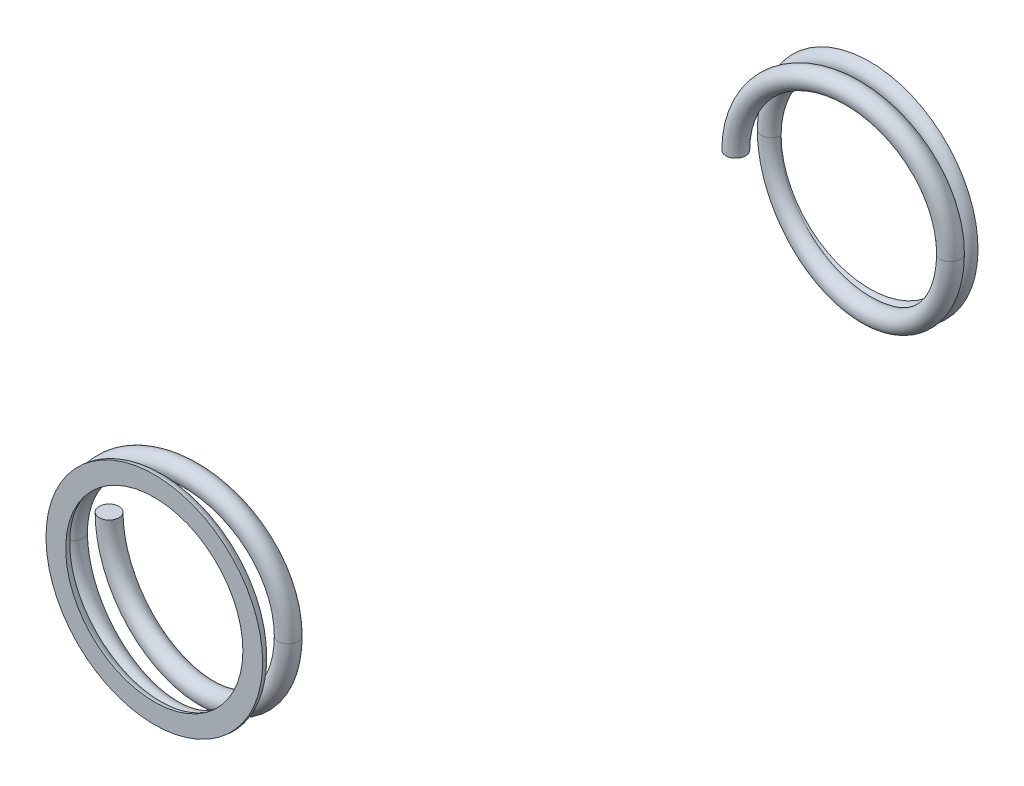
ISO-10303-21;
HEADER;
FILE_DESCRIPTION(('STEP AP214'),'2;1');
FILE_NAME('part.step','',(''),(''),'','','');
FILE_SCHEMA(('AUTOMOTIVE_DESIGN { 1 0 10303 214 1 1 1 1 }'));
ENDSEC;
DATA;
#1=APPLICATION_CONTEXT('core data for automotive mechanical design processes');
#2=APPLICATION_PROTOCOL_DEFINITION('international standard','automotive_design',2000,#1);
#3=PRODUCT_CONTEXT('',#1,'mechanical');
#4=PRODUCT('Part','Part','',(#3));
#5=PRODUCT_RELATED_PRODUCT_CATEGORY('part','',(#4));
#6=PRODUCT_DEFINITION_FORMATION('','',#4);
#7=PRODUCT_DEFINITION_CONTEXT('part definition',#1,'design');
#8=PRODUCT_DEFINITION('design','',#6,#7);
#9=PRODUCT_DEFINITION_SHAPE('','',#8);
#10=(LENGTH_UNIT() NAMED_UNIT(*) SI_UNIT(.MILLI.,.METRE.));
#11=(NAMED_UNIT(*) PLANE_ANGLE_UNIT() SI_UNIT($,.RADIAN.));
#12=(NAMED_UNIT(*) SI_UNIT($,.STERADIAN.) SOLID_ANGLE_UNIT());
#13=UNCERTAINTY_MEASURE_WITH_UNIT(LENGTH_MEASURE(1.E-05),#10,'distance_accuracy_value','');
#14=(GEOMETRIC_REPRESENTATION_CONTEXT(3) GLOBAL_UNCERTAINTY_ASSIGNED_CONTEXT((#13)) GLOBAL_UNIT_ASSIGNED_CONTEXT((#10,
#11,#12)) REPRESENTATION_CONTEXT('',''));
#15=CARTESIAN_POINT('',(0.,0.,0.));
#16=DIRECTION('',(0.,0.,1.));
#17=DIRECTION('',(1.,0.,0.));
#18=AXIS2_PLACEMENT_3D('',#15,#16,#17);
#19=CARTESIAN_POINT('',(0.,0.,-57.15));
#20=DIRECTION('',(0.,0.,1.));
#21=DIRECTION('',(1.,0.,0.));
#22=AXIS2_PLACEMENT_3D('',#19,#20,#21);
#23=TOROIDAL_SURFACE('',#22,7.86511,0.7874);
#24=CARTESIAN_POINT('',(0.,0.,-57.15));
#25=DIRECTION('',(0.,0.,-1.));
#26=DIRECTION('',(-1.,0.,0.));
#27=AXIS2_PLACEMENT_3D('',#24,#25,#26);
#28=CIRCLE('',#27,7.07771);
#29=CARTESIAN_POINT('',(-7.07771,0.,-57.15));
#30=VERTEX_POINT('',#29);
#31=EDGE_CURVE('E91',#30,#30,#28,.T.);
#32=ORIENTED_EDGE('',*,*,#31,.T.);
#33=EDGE_LOOP('',(#32));
#34=FACE_BOUND('',#33,.T.);
#35=CARTESIAN_POINT('',(0.,0.,-57.15));
#36=DIRECTION('',(0.,0.,1.));
#37=DIRECTION('',(1.,0.,0.));
#38=AXIS2_PLACEMENT_3D('',#35,#36,#37);
#39=CIRCLE('',#38,8.65251);
#40=CARTESIAN_POINT('',(-7.07770999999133,-4.97714280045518,-57.1499999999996));
#41=VERTEX_POINT('',#40);
#42=CARTESIAN_POINT('',(-8.65251,-1.40859546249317E-11,-57.15));
#43=VERTEX_POINT('',#42);
#44=EDGE_CURVE('E71',#41,#43,#39,.T.);
#45=ORIENTED_EDGE('',*,*,#44,.T.);
#46=CARTESIAN_POINT('',(-7.86511000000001,0.,-57.15));
#47=DIRECTION('',(0.,1.,0.));
#48=DIRECTION('',(0.,0.,1.));
#49=AXIS2_PLACEMENT_3D('',#46,#47,#48);
#50=CIRCLE('',#49,0.7874);
#51=CARTESIAN_POINT('',(-7.08088685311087,0.,-57.0793401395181));
#52=VERTEX_POINT('',#51);
#53=EDGE_CURVE('E78',#43,#52,#50,.T.);
#54=ORIENTED_EDGE('',*,*,#53,.T.);
#55=CARTESIAN_POINT('',(-7.08088685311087,0.,-57.0793401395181));
#56=CARTESIAN_POINT('',(-7.08088745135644,-0.0418049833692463,-57.0793401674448));
#57=CARTESIAN_POINT('',(-7.08051854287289,-0.0836140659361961,-57.0793236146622));
#58=CARTESIAN_POINT('',(-7.07544794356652,-0.37083157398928,-57.0790960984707));
#59=CARTESIAN_POINT('',(-7.05839479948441,-0.616140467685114,-57.0783309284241));
#60=CARTESIAN_POINT('',(-6.99687829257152,-1.121052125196,-57.0755711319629));
#61=CARTESIAN_POINT('',(-6.95054936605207,-1.38042869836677,-57.0734928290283));
#62=CARTESIAN_POINT('',(-6.86008169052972,-1.7631751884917,-57.0694356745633));
#63=CARTESIAN_POINT('',(-6.82661920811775,-1.88917331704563,-57.0679351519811));
#64=CARTESIAN_POINT('',(-6.71542585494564,-2.26584296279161,-57.0629498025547));
#65=CARTESIAN_POINT('',(-6.62719015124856,-2.5135083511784,-57.0589947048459));
#66=CARTESIAN_POINT('',(-6.42385037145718,-2.99792914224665,-57.0498842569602));
#67=CARTESIAN_POINT('',(-6.30870502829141,-3.23466711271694,-57.0447270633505));
#68=CARTESIAN_POINT('',(-6.08289071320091,-3.64050846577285,-57.034618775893));
#69=CARTESIAN_POINT('',(-5.97741718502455,-3.81252944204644,-57.0298990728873));
#70=CARTESIAN_POINT('',(-5.75232713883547,-4.14712004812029,-57.0198315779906));
#71=CARTESIAN_POINT('',(-5.63270673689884,-4.30968706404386,-57.0144836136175));
#72=CARTESIAN_POINT('',(-5.38018612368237,-4.62423876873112,-57.0031999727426));
#73=CARTESIAN_POINT('',(-5.247280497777,-4.77621909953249,-56.9972640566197));
#74=CARTESIAN_POINT('',(-4.96915137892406,-5.06853880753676,-56.9848493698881));
#75=CARTESIAN_POINT('',(-4.8239233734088,-5.20887388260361,-56.978370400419));
#76=CARTESIAN_POINT('',(-4.52212632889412,-5.47699417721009,-56.9649151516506));
#77=CARTESIAN_POINT('',(-4.36554832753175,-5.60476928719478,-56.9579384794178));
#78=CARTESIAN_POINT('',(-4.04222213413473,-5.84682988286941,-56.943542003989));
#79=CARTESIAN_POINT('',(-3.8754702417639,-5.96111041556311,-56.9361220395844));
#80=CARTESIAN_POINT('',(-3.53312331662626,-6.17531794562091,-56.9209000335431));
#81=CARTESIAN_POINT('',(-3.35753274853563,-6.27525209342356,-56.9130981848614));
#82=CARTESIAN_POINT('',(-2.99860467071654,-6.46021913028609,-56.8971630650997));
#83=CARTESIAN_POINT('',(-2.81526430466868,-6.54524646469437,-56.8890296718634));
#84=CARTESIAN_POINT('',(-2.44014245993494,-6.70065496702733,-56.8724026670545));
#85=CARTESIAN_POINT('',(-2.24829071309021,-6.77086623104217,-56.8639060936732));
#86=CARTESIAN_POINT('',(-1.85932909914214,-6.89503350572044,-56.8466959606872));
#87=CARTESIAN_POINT('',(-1.66221728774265,-6.94898341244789,-56.837982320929));
#88=CARTESIAN_POINT('',(-1.2642541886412,-7.04024386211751,-56.8204069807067));
#89=CARTESIAN_POINT('',(-1.06340414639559,-7.07755984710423,-56.8115453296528));
#90=CARTESIAN_POINT('',(-0.659210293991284,-7.13537230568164,-56.7937305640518));
#91=CARTESIAN_POINT('',(-0.455865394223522,-7.15586114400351,-56.784777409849));
#92=CARTESIAN_POINT('',(-0.0459581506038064,-7.18001630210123,-56.7667493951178));
#93=CARTESIAN_POINT('',(0.1606151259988,-7.18349713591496,-56.7576742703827));
#94=CARTESIAN_POINT('',(0.573237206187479,-7.17314503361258,-56.7395685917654));
#95=CARTESIAN_POINT('',(0.779286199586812,-7.1593196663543,-56.7305380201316));
#96=CARTESIAN_POINT('',(1.18959006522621,-7.11448383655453,-56.712578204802));
#97=CARTESIAN_POINT('',(1.39384422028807,-7.08346679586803,-56.7036490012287));
#98=CARTESIAN_POINT('',(1.79898041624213,-7.00449557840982,-56.6859618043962));
#99=CARTESIAN_POINT('',(1.99986366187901,-6.95654759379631,-56.6772037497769));
#100=CARTESIAN_POINT('',(2.39858945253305,-6.8435926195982,-56.6598450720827));
#101=CARTESIAN_POINT('',(2.59639291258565,-6.77844732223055,-56.6512463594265));
#102=CARTESIAN_POINT('',(2.98576331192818,-6.63178159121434,-56.6343460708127));
#103=CARTESIAN_POINT('',(3.1773324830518,-6.55026709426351,-56.6260443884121));
#104=CARTESIAN_POINT('',(3.5530951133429,-6.37135374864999,-56.6097873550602));
#105=CARTESIAN_POINT('',(3.73728297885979,-6.27394312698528,-56.6018322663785));
#106=CARTESIAN_POINT('',(4.09675261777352,-6.06399575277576,-56.5863339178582));
#107=CARTESIAN_POINT('',(4.27203767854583,-5.95146464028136,-56.5787905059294));
#108=CARTESIAN_POINT('',(4.61308227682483,-5.71162263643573,-56.5641409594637));
#109=CARTESIAN_POINT('',(4.77880818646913,-5.58426382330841,-56.5570363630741));
#110=CARTESIAN_POINT('',(5.09882119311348,-5.31599588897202,-56.5433447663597));
#111=CARTESIAN_POINT('',(5.25311261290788,-5.17509193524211,-56.5367575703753));
#112=CARTESIAN_POINT('',(5.54900182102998,-4.8808234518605,-56.5241515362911));
#113=CARTESIAN_POINT('',(5.69061354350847,-4.72747296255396,-56.5181320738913));
#114=CARTESIAN_POINT('',(5.96018620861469,-4.40928930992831,-56.5066983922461));
#115=CARTESIAN_POINT('',(6.08815262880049,-4.244460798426,-56.5012839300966));
#116=CARTESIAN_POINT('',(6.32674739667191,-3.90823603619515,-56.4912111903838));
#117=CARTESIAN_POINT('',(6.43770109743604,-3.73707103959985,-56.4865386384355));
#118=CARTESIAN_POINT('',(6.64465020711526,-3.38609039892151,-56.477842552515));
#119=CARTESIAN_POINT('',(6.7406578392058,-3.2062819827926,-56.4738184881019));
#120=CARTESIAN_POINT('',(6.9136575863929,-2.84604425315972,-56.4665826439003));
#121=CARTESIAN_POINT('',(6.99123020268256,-2.66589399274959,-56.4633459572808));
#122=CARTESIAN_POINT('',(7.13120229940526,-2.29968836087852,-56.4575164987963));
#123=CARTESIAN_POINT('',(7.193595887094,-2.11363072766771,-56.4549239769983));
#124=CARTESIAN_POINT('',(7.29609538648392,-1.75934390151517,-56.450671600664));
#125=CARTESIAN_POINT('',(7.33796907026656,-1.59162467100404,-56.448937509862));
#126=CARTESIAN_POINT('',(7.40913163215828,-1.25347539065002,-56.4459936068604));
#127=CARTESIAN_POINT('',(7.43841691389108,-1.08304458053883,-56.4447839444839));
#128=CARTESIAN_POINT('',(7.48419909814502,-0.739953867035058,-56.4428939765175));
#129=CARTESIAN_POINT('',(7.50065769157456,-0.567288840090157,-56.4422152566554));
#130=CARTESIAN_POINT('',(7.52052005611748,-0.22123738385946,-56.4413965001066));
#131=CARTESIAN_POINT('',(7.52392595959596,-0.0478510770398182,-56.4412563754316));
#132=CARTESIAN_POINT('',(7.52074732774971,0.125420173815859,-56.4413871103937));
#133=B_SPLINE_CURVE_WITH_KNOTS('',3,(#55,#56,#57,#58,#59,#60,#61,#62,#63,#64,#65,#66,#67,#68,
#69,#70,#71,#72,#73,#74,#75,#76,#77,#78,#79,#80,#81,#82,#83,#84,#85,#86,#87,#88,#89,#90,#91,#92,
#93,#94,#95,#96,#97,#98,#99,#100,#101,#102,#103,#104,#105,#106,#107,#108,#109,#110,#111,#112,
#113,#114,#115,#116,#117,#118,#119,#120,#121,#122,#123,#124,#125,#126,#127,#128,#129,#130,#131,
#132),.UNSPECIFIED.,.F.,.F.,(4,2,2,2,2,2,2,2,2,2,2,2,2,2,2,2,2,2,2,2,2,2,2,2,2,2,2,2,2,2,2,2,2,
2,2,2,2,2,4),(0.,0.125425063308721,0.861698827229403,1.65040724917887,2.0413971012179,
2.82847433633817,3.61676660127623,4.22159024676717,4.82658032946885,5.43181799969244,
6.03727827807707,6.64322196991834,7.24938737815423,7.8552496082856,8.46133712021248,
9.07403681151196,9.68696620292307,10.2996949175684,10.9127015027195,11.5323787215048,
12.1517850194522,12.7714284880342,13.3908455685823,14.0154046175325,14.6397375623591,
15.2645350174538,15.8891000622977,16.5157428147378,17.1421474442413,17.7678550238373,
18.393310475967,19.0046915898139,19.615570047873,20.2034147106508,20.7914872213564,
21.3096506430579,21.8279620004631,22.347815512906,22.8675840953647),.UNSPECIFIED.);
#134=CARTESIAN_POINT('',(7.52189029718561,0.,-56.44134));
#135=VERTEX_POINT('',#134);
#136=EDGE_CURVE('E97',#52,#135,#133,.T.);
#137=ORIENTED_EDGE('',*,*,#136,.T.);
#138=CARTESIAN_POINT('',(8.20832970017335,-0.000200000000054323,-56.4413399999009));
#139=CARTESIAN_POINT('',(8.20836546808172,0.263350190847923,-56.4413401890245));
#140=CARTESIAN_POINT('',(8.1945853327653,0.526960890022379,-56.440824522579));
#141=CARTESIAN_POINT('',(8.13940331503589,1.05292496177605,-56.4387533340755));
#142=CARTESIAN_POINT('',(8.09783049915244,1.31526037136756,-56.437191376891));
#143=CARTESIAN_POINT('',(7.99955823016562,1.77549211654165,-56.4334895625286));
#144=CARTESIAN_POINT('',(7.94838045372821,1.9745849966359,-56.4315593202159));
#145=CARTESIAN_POINT('',(7.82953620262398,2.36792222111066,-56.4270658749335));
#146=CARTESIAN_POINT('',(7.76186101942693,2.56216394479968,-56.4245023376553));
#147=CARTESIAN_POINT('',(7.61040407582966,2.94345048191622,-56.4187498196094));
#148=CARTESIAN_POINT('',(7.5266805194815,3.13051845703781,-56.4155630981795));
#149=CARTESIAN_POINT('',(7.34303014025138,3.49636471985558,-56.4085550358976));
#150=CARTESIAN_POINT('',(7.24311954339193,3.67515108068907,-56.4047343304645));
#151=CARTESIAN_POINT('',(7.08289889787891,3.93208036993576,-56.398599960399));
#152=CARTESIAN_POINT('',(7.02897754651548,4.01426025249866,-56.3965344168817));
#153=CARTESIAN_POINT('',(6.91709088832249,4.17592785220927,-56.3922493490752));
#154=CARTESIAN_POINT('',(6.85912265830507,4.25541356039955,-56.3900297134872));
#155=CARTESIAN_POINT('',(6.73852647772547,4.4114882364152,-56.3854208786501));
#156=CARTESIAN_POINT('',(6.67587357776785,4.48805785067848,-56.3830307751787));
#157=CARTESIAN_POINT('',(6.54569397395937,4.63679964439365,-56.3780885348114));
#158=CARTESIAN_POINT('',(6.47817727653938,4.70898031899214,-56.3755367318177));
#159=CARTESIAN_POINT('',(6.38915375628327,4.79445754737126,-56.3722332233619));
#160=CARTESIAN_POINT('',(6.37108814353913,4.81134194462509,-56.3715657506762));
#161=CARTESIAN_POINT('',(6.33432986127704,4.84449328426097,-56.3702175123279));
#162=CARTESIAN_POINT('',(6.31563609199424,4.86075902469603,-56.369536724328));
#163=CARTESIAN_POINT('',(6.27768616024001,4.89214809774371,-56.3681711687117));
#164=CARTESIAN_POINT('',(6.25843912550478,4.90728256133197,-56.3674865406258));
#165=CARTESIAN_POINT('',(6.21887407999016,4.93605155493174,-56.3661069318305));
#166=CARTESIAN_POINT('',(6.19855984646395,4.94969090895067,-56.3654119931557));
#167=CARTESIAN_POINT('',(6.16835697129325,4.9660390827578,-56.3644351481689));
#168=CARTESIAN_POINT('',(6.15943990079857,4.97042942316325,-56.3641530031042));
#169=CARTESIAN_POINT('',(6.1455600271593,4.97591001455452,-56.3637347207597));
#170=CARTESIAN_POINT('',(6.14082169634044,4.97755872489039,-56.3635953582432));
#171=CARTESIAN_POINT('',(6.13116098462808,4.98021010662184,-56.3633225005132));
#172=CARTESIAN_POINT('',(6.12623963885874,4.98121595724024,-56.3631889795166));
#173=CARTESIAN_POINT('',(6.11924672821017,4.98173716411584,-56.3630140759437));
#174=CARTESIAN_POINT('',(6.11722036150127,4.98178312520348,-56.3629651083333));
#175=CARTESIAN_POINT('',(6.11318178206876,4.98158123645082,-56.3628723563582));
#176=CARTESIAN_POINT('',(6.11116954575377,4.9813341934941,-56.3628285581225));
#177=CARTESIAN_POINT('',(6.10785218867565,4.98059119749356,-56.3627619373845));
#178=CARTESIAN_POINT('',(6.10652455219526,4.98019856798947,-56.3627368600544));
#179=CARTESIAN_POINT('',(6.10394959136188,4.97920411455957,-56.3626921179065));
#180=CARTESIAN_POINT('',(6.10270216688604,4.97860255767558,-56.3626724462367));
#181=CARTESIAN_POINT('',(6.10032773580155,4.97717673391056,-56.3626397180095));
#182=CARTESIAN_POINT('',(6.09920167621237,4.97635087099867,-56.3626267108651));
#183=CARTESIAN_POINT('',(6.09712479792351,4.97450220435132,-56.3626082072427));
#184=CARTESIAN_POINT('',(6.09617405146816,4.97347931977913,-56.3626027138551));
#185=CARTESIAN_POINT('',(6.09436605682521,4.97115696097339,-56.3625986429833));
#186=CARTESIAN_POINT('',(6.09353263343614,4.96983914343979,-56.3626009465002));
#187=CARTESIAN_POINT('',(6.09209024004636,4.96708641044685,-56.3626129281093));
#188=CARTESIAN_POINT('',(6.09148171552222,4.96565126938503,-56.3626226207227));
#189=CARTESIAN_POINT('',(6.09012151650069,4.96176915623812,-56.3626557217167));
#190=CARTESIAN_POINT('',(6.08953097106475,4.95926699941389,-56.362683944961));
#191=CARTESIAN_POINT('',(6.08871025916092,4.95420602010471,-56.3627500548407));
#192=CARTESIAN_POINT('',(6.08848120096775,4.95164704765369,-56.3627879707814));
#193=CARTESIAN_POINT('',(6.08804407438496,4.94137481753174,-56.3629518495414));
#194=CARTESIAN_POINT('',(6.08880280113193,4.93363552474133,-56.3631016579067));
#195=CARTESIAN_POINT('',(6.09123139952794,4.9183029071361,-56.3634209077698));
#196=CARTESIAN_POINT('',(6.09290811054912,4.91071112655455,-56.3635904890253));
#197=CARTESIAN_POINT('',(6.09919637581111,4.88617235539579,-56.3641596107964));
#198=CARTESIAN_POINT('',(6.10484373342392,4.869491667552,-56.3645796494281));
#199=CARTESIAN_POINT('',(6.11713724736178,4.83649677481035,-56.3654369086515));
#200=CARTESIAN_POINT('',(6.12378623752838,4.82018376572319,-56.3658741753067));
#201=CARTESIAN_POINT('',(6.14455131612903,4.77163514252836,-56.3671973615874));
#202=CARTESIAN_POINT('',(6.15949847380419,4.73975278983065,-56.368095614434));
#203=CARTESIAN_POINT('',(6.20518518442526,4.64533779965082,-56.3707798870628));
#204=CARTESIAN_POINT('',(6.23705025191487,4.58337775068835,-56.3725735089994));
#205=CARTESIAN_POINT('',(6.30123810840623,4.45963686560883,-56.3761345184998));
#206=CARTESIAN_POINT('',(6.33356122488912,4.39785620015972,-56.3779018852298));
#207=CARTESIAN_POINT('',(6.39781542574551,4.27422549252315,-56.3813899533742));
#208=CARTESIAN_POINT('',(6.42974709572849,4.21237575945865,-56.3831107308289));
#209=CARTESIAN_POINT('',(6.4928540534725,4.08830366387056,-56.3864989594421));
#210=CARTESIAN_POINT('',(6.52402947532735,4.02608136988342,-56.3881664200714));
#211=CARTESIAN_POINT('',(6.61511469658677,3.84061955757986,-56.3930288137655));
#212=CARTESIAN_POINT('',(6.67360019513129,3.71667002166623,-56.3961384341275));
#213=CARTESIAN_POINT('',(6.78570329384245,3.46656875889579,-56.4020945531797));
#214=CARTESIAN_POINT('',(6.83932071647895,3.3404169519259,-56.404941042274));
#215=CARTESIAN_POINT('',(6.94116582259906,3.08583080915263,-56.4103497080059));
#216=CARTESIAN_POINT('',(6.98938937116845,2.957394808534,-56.4129116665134));
#217=CARTESIAN_POINT('',(7.08001336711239,2.69846229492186,-56.4177301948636));
#218=CARTESIAN_POINT('',(7.12241304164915,2.56796551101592,-56.4199867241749));
#219=CARTESIAN_POINT('',(7.22068961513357,2.23967628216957,-56.4252221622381));
#220=CARTESIAN_POINT('',(7.27276648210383,2.04072647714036,-56.428001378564));
#221=CARTESIAN_POINT('',(7.36251687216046,1.63956954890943,-56.4327973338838));
#222=CARTESIAN_POINT('',(7.40018834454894,1.43736196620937,-56.4348139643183));
#223=CARTESIAN_POINT('',(7.46080569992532,1.02984812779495,-56.4380615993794));
#224=CARTESIAN_POINT('',(7.48368757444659,0.824532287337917,-56.4392891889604));
#225=CARTESIAN_POINT('',(7.51424892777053,0.412747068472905,-56.440929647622));
#226=CARTESIAN_POINT('',(7.52192666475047,0.206277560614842,-56.4413424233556));
#227=CARTESIAN_POINT('',(7.52189029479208,-0.000200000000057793,-56.4413399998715));
#228=B_SPLINE_CURVE_WITH_KNOTS('',3,(#138,#139,#140,#141,#142,#143,#144,#145,#146,#147,#148,
#149,#150,#151,#152,#153,#154,#155,#156,#157,#158,#159,#160,#161,#162,#163,#164,#165,#166,#167,
#168,#169,#170,#171,#172,#173,#174,#175,#176,#177,#178,#179,#180,#181,#182,#183,#184,#185,#186,
#187,#188,#189,#190,#191,#192,#193,#194,#195,#196,#197,#198,#199,#200,#201,#202,#203,#204,#205,
#206,#207,#208,#209,#210,#211,#212,#213,#214,#215,#216,#217,#218,#219,#220,#221,#222,#223,#224,
#225,#226,#227),.UNSPECIFIED.,.F.,.F.,(4,2,2,2,2,2,2,2,2,2,2,2,2,2,2,2,2,2,2,2,2,2,2,2,2,2,2,2,
2,2,2,2,2,2,2,2,2,2,2,2,2,2,2,2,4),(0.,0.790407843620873,1.58572221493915,2.20177227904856,
2.81814824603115,3.4323296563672,4.04589917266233,4.34074526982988,4.63580659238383,
4.93256988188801,5.22873916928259,5.30293982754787,5.37727796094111,5.45074717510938,
5.52397189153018,5.55371833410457,5.56875905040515,5.58372479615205,5.58979320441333,
5.59584494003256,5.59998433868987,5.60411846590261,5.60828281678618,5.61244887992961,
5.61710066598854,5.62176161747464,5.62943105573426,5.63712396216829,5.66027297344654,
5.68359684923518,5.73631156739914,5.78917832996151,5.89479404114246,6.1038801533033,
6.31312415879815,6.52200307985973,6.73084468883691,7.14202354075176,7.55321738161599,
7.96472431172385,8.37628579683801,8.99275337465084,9.609308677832,10.2285148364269,
10.8477919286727),.UNSPECIFIED.);
#229=CARTESIAN_POINT('',(8.2083297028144,0.,-56.44134));
#230=VERTEX_POINT('',#229);
#231=EDGE_CURVE('E105',#230,#135,#228,.T.);
#232=ORIENTED_EDGE('',*,*,#231,.F.);
#233=CARTESIAN_POINT('',(-8.64933314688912,0.,-57.2206598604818));
#234=CARTESIAN_POINT('',(-8.64933375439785,-0.041802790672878,-57.2206598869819));
#235=CARTESIAN_POINT('',(-8.6490317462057,-0.0836115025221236,-57.2206463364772));
#236=CARTESIAN_POINT('',(-8.64489850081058,-0.369562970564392,-57.22046088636));
#237=CARTESIAN_POINT('',(-8.63106080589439,-0.613704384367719,-57.2198400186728));
#238=CARTESIAN_POINT('',(-8.60531973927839,-0.87335750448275,-57.2186849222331));
#239=CARTESIAN_POINT('',(-8.60361571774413,-0.890052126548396,-57.2186084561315));
#240=CARTESIAN_POINT('',(-8.59485344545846,-0.973503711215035,-57.2182152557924));
#241=CARTESIAN_POINT('',(-8.58706993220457,-1.04018342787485,-57.2178659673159));
#242=CARTESIAN_POINT('',(-8.54424244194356,-1.37340388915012,-57.2159440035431));
#243=CARTESIAN_POINT('',(-8.49754782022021,-1.63859556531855,-57.2138483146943));
#244=CARTESIAN_POINT('',(-8.40058117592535,-2.07064705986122,-57.2094951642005));
#245=CARTESIAN_POINT('',(-8.35739045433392,-2.23917297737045,-57.2075559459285));
#246=CARTESIAN_POINT('',(-8.21188705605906,-2.74321604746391,-57.2010216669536));
#247=CARTESIAN_POINT('',(-8.0940928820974,-3.07441892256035,-57.1957301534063));
#248=CARTESIAN_POINT('',(-7.81891204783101,-3.72052135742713,-57.1833610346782));
#249=CARTESIAN_POINT('',(-7.66145891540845,-4.03539246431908,-57.1762804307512));
#250=CARTESIAN_POINT('',(-7.36464075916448,-4.54804001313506,-57.1629225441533));
#251=CARTESIAN_POINT('',(-7.23508868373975,-4.75157070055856,-57.1570897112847));
#252=CARTESIAN_POINT('',(-6.95929852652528,-5.14706835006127,-57.1446657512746));
#253=CARTESIAN_POINT('',(-6.81305687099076,-5.33903282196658,-57.1380744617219));
#254=CARTESIAN_POINT('',(-6.50487137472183,-5.70998716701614,-57.1241754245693));
#255=CARTESIAN_POINT('',(-6.34292233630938,-5.88897271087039,-57.1168674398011));
#256=CARTESIAN_POINT('',(-6.00447730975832,-6.23259149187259,-57.101584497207));
#257=CARTESIAN_POINT('',(-5.82798129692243,-6.39722470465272,-57.0936095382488));
#258=CARTESIAN_POINT('',(-5.46189040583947,-6.71072773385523,-57.0770553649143));
#259=CARTESIAN_POINT('',(-5.27231118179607,-6.85961586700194,-57.0684768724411));
#260=CARTESIAN_POINT('',(-4.88119886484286,-7.14073513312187,-57.0507647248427));
#261=CARTESIAN_POINT('',(-4.67966560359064,-7.27296603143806,-57.0416310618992));
#262=CARTESIAN_POINT('',(-4.26614101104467,-7.51972529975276,-57.0228736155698));
#263=CARTESIAN_POINT('',(-4.05415284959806,-7.63425899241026,-57.0132499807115));
#264=CARTESIAN_POINT('',(-3.62110523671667,-7.84482524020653,-56.9935728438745));
#265=CARTESIAN_POINT('',(-3.40004269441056,-7.94085142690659,-56.9835191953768));
#266=CARTESIAN_POINT('',(-2.95292041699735,-8.11267590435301,-56.963164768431));
#267=CARTESIAN_POINT('',(-2.726939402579,-8.1886795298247,-56.9528677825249));
#268=CARTESIAN_POINT('',(-2.26934323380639,-8.3211995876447,-56.9319957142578));
#269=CARTESIAN_POINT('',(-2.03772805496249,-8.37771593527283,-56.9214206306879));
#270=CARTESIAN_POINT('',(-1.57054141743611,-8.4708031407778,-56.9000666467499));
#271=CARTESIAN_POINT('',(-1.33497011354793,-8.50737477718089,-56.8892877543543));
#272=CARTESIAN_POINT('',(-0.861564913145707,-8.56026643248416,-56.8676014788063));
#273=CARTESIAN_POINT('',(-0.623730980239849,-8.57658612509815,-56.8566940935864));
#274=CARTESIAN_POINT('',(-0.149966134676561,-8.58875104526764,-56.834940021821));
#275=CARTESIAN_POINT('',(0.0859595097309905,-8.58480296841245,-56.8240938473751));
#276=CARTESIAN_POINT('',(0.556709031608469,-8.55689678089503,-56.8024243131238));
#277=CARTESIAN_POINT('',(0.791532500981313,-8.53293176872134,-56.7916009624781));
#278=CARTESIAN_POINT('',(1.25819896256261,-8.46513986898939,-56.7700621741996));
#279=CARTESIAN_POINT('',(1.49004316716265,-8.42132134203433,-56.759346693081));
#280=CARTESIAN_POINT('',(1.94925682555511,-8.31409772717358,-56.7380915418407));
#281=CARTESIAN_POINT('',(2.1766246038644,-8.25068544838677,-56.7275519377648));
#282=CARTESIAN_POINT('',(2.62338919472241,-8.10529402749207,-56.706809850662));
#283=CARTESIAN_POINT('',(2.84283442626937,-8.02346391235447,-56.6966053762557));
#284=CARTESIAN_POINT('',(3.27411445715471,-7.84150651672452,-56.6765169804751));
#285=CARTESIAN_POINT('',(3.4859464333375,-7.74137253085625,-56.6666331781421));
#286=CARTESIAN_POINT('',(3.90033118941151,-7.52357991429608,-56.6472639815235));
#287=CARTESIAN_POINT('',(4.10288698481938,-7.40592703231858,-56.6377784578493));
#288=CARTESIAN_POINT('',(4.49742519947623,-7.15387692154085,-56.6192670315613));
#289=CARTESIAN_POINT('',(4.6894036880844,-7.01947352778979,-56.6102412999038));
#290=CARTESIAN_POINT('',(5.0608128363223,-6.73534805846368,-56.5927435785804));
#291=CARTESIAN_POINT('',(5.24027820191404,-6.58567144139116,-56.5842700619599));
#292=CARTESIAN_POINT('',(5.58608895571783,-6.27171755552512,-56.5679061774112));
#293=CARTESIAN_POINT('',(5.75242953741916,-6.1074349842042,-56.5600160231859));
#294=CARTESIAN_POINT('',(6.0706956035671,-5.76560848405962,-56.5448833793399));
#295=CARTESIAN_POINT('',(6.22263037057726,-5.58807322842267,-56.5376404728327));
#296=CARTESIAN_POINT('',(6.51124054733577,-5.22095002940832,-56.5238471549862));
#297=CARTESIAN_POINT('',(6.64791021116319,-5.03135758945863,-56.5172970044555));
#298=CARTESIAN_POINT('',(7.03531826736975,-4.44395677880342,-56.498679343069));
#299=CARTESIAN_POINT('',(7.26157485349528,-4.02954979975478,-56.4877341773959));
#300=CARTESIAN_POINT('',(7.64344085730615,-3.16936283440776,-56.4691644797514));
#301=CARTESIAN_POINT('',(7.79899666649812,-2.72355933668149,-56.4615424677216));
#302=CARTESIAN_POINT('',(8.04046838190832,-1.79979580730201,-56.4496644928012));
#303=CARTESIAN_POINT('',(8.12430456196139,-1.32128418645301,-56.4455091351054));
#304=CARTESIAN_POINT('',(8.19175431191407,-0.598776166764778,-56.4421634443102));
#305=CARTESIAN_POINT('',(8.20451985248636,-0.357145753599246,-56.4415294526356));
#306=CARTESIAN_POINT('',(8.21066778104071,0.126329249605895,-56.4412236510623));
#307=CARTESIAN_POINT('',(8.20405288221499,0.36817380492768,-56.4415517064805));
#308=CARTESIAN_POINT('',(8.18777620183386,0.609477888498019,-56.4423605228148));
#309=B_SPLINE_CURVE_WITH_KNOTS('',3,(#233,#234,#235,#236,#237,#238,#239,#240,#241,#242,#243,
#244,#245,#246,#247,#248,#249,#250,#251,#252,#253,#254,#255,#256,#257,#258,#259,#260,#261,#262,
#263,#264,#265,#266,#267,#268,#269,#270,#271,#272,#273,#274,#275,#276,#277,#278,#279,#280,#281,
#282,#283,#284,#285,#286,#287,#288,#289,#290,#291,#292,#293,#294,#295,#296,#297,#298,#299,#300,
#301,#302,#303,#304,#305,#306,#307,#308),.UNSPECIFIED.,.F.,.F.,(4,2,2,2,2,2,2,2,2,2,2,2,2,2,2,2,
2,2,2,2,2,2,2,2,2,2,2,2,2,2,2,2,2,2,2,2,2,4),(0.,0.12542345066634,0.857836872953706,
0.908181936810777,1.10957492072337,1.91596523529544,2.43770179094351,3.48956872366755,
4.54321055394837,5.26642172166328,5.98978804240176,6.71339455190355,7.43700228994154,
8.15975875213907,8.88252539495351,9.6050742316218,10.3278712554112,11.0429387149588,
11.7580092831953,12.4730519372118,13.1881061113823,13.8958825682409,14.6039031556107,
15.3116258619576,16.019608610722,16.722056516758,17.4247622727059,18.1272379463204,
18.8299729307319,19.5306741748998,20.2316308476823,20.9321327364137,21.6328974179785,
23.0426201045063,24.4534099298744,25.9038432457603,26.6290855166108,27.3542262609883),.UNSPECIFIED.);
#310=EDGE_CURVE('E66',#230,#41,#309,.F.);
#311=ORIENTED_EDGE('',*,*,#310,.T.);
#312=EDGE_LOOP('',(#45,#54,#137,#232,#311));
#313=FACE_BOUND('',#312,.T.);
#314=ADVANCED_FACE('F53',(#34,#313),#23,.T.);
#315=CARTESIAN_POINT('',(0.,0.,-56.44134));
#316=DIRECTION('',(0.0897382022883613,0.,-0.995965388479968));
#317=DIRECTION('',(-0.995965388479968,0.,-0.0897382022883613));
#318=AXIS2_PLACEMENT_3D('',#315,#316,#317);
#319=TOROIDAL_SURFACE('',#318,7.89697121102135,0.7874);
#320=CARTESIAN_POINT('',(-0.150793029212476,-7.51874941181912,-57.15));
#321=CARTESIAN_POINT('',(-0.0897193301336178,-7.53059846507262,-57.15));
#322=CARTESIAN_POINT('',(-0.0286047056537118,-7.5422295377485,-57.15));
#323=CARTESIAN_POINT('',(0.0936476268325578,-7.56538930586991,-57.15));
#324=CARTESIAN_POINT('',(0.154785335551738,-7.57691799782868,-57.15));
#325=CARTESIAN_POINT('',(0.276889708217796,-7.60040061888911,-57.15));
#326=CARTESIAN_POINT('',(0.337856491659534,-7.61235395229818,-57.15));
#327=CARTESIAN_POINT('',(0.459519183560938,-7.637632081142,-57.15));
#328=CARTESIAN_POINT('',(0.520215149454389,-7.65095656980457,-57.15));
#329=CARTESIAN_POINT('',(0.611478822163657,-7.6740182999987,-57.15));
#330=CARTESIAN_POINT('',(0.642395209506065,-7.6823655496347,-57.15));
#331=CARTESIAN_POINT('',(0.70376895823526,-7.70083384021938,-57.15));
#332=CARTESIAN_POINT('',(0.73422592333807,-7.71095632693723,-57.15));
#333=CARTESIAN_POINT('',(0.778934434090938,-7.72881641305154,-57.15));
#334=CARTESIAN_POINT('',(0.793707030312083,-7.73523355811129,-57.15));
#335=CARTESIAN_POINT('',(0.82256168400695,-7.74944773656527,-57.15));
#336=CARTESIAN_POINT('',(0.836645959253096,-7.75723990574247,-57.15));
#337=CARTESIAN_POINT('',(0.855381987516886,-7.76982649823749,-57.15));
#338=CARTESIAN_POINT('',(0.860672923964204,-7.77365711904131,-57.15));
#339=CARTESIAN_POINT('',(0.870880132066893,-7.78182071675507,-57.15));
#340=CARTESIAN_POINT('',(0.875795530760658,-7.78615480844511,-57.15));
#341=CARTESIAN_POINT('',(0.885097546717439,-7.79550357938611,-57.15));
#342=CARTESIAN_POINT('',(0.889475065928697,-7.80052754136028,-57.15));
#343=CARTESIAN_POINT('',(0.897221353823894,-7.81129844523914,-57.15));
#344=CARTESIAN_POINT('',(0.900595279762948,-7.81704146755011,-57.15));
#345=CARTESIAN_POINT('',(0.904841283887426,-7.82687134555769,-57.15));
#346=CARTESIAN_POINT('',(0.906176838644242,-7.8307569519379,-57.15));
#347=CARTESIAN_POINT('',(0.908167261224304,-7.83869916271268,-57.15));
#348=CARTESIAN_POINT('',(0.908822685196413,-7.84275562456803,-57.15));
#349=CARTESIAN_POINT('',(0.909413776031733,-7.85092094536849,-57.15));
#350=CARTESIAN_POINT('',(0.909349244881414,-7.85502981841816,-57.15));
#351=CARTESIAN_POINT('',(0.908546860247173,-7.86318134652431,-57.15));
#352=CARTESIAN_POINT('',(0.907808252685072,-7.86722392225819,-57.15));
#353=CARTESIAN_POINT('',(0.905349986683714,-7.87674339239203,-57.15));
#354=CARTESIAN_POINT('',(0.903356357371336,-7.88214845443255,-57.15));
#355=CARTESIAN_POINT('',(0.898555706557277,-7.89258215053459,-57.15));
#356=CARTESIAN_POINT('',(0.895746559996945,-7.89760975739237,-57.15));
#357=CARTESIAN_POINT('',(0.886973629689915,-7.91136416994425,-57.15));
#358=CARTESIAN_POINT('',(0.880340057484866,-7.9196569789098,-57.15));
#359=CARTESIAN_POINT('',(0.866028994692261,-7.93527483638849,-57.15));
#360=CARTESIAN_POINT('',(0.858348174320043,-7.9425966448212,-57.15));
#361=CARTESIAN_POINT('',(0.824503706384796,-7.97220225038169,-57.15));
#362=CARTESIAN_POINT('',(0.795540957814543,-7.99119228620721,-57.15));
#363=CARTESIAN_POINT('',(0.735659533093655,-8.02571179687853,-57.15));
#364=CARTESIAN_POINT('',(0.704729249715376,-8.04121769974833,-57.15));
#365=CARTESIAN_POINT('',(0.642906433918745,-8.06936599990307,-57.15));
#366=CARTESIAN_POINT('',(0.612052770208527,-8.08209150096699,-57.15));
#367=CARTESIAN_POINT('',(0.549726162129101,-8.10593670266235,-57.15));
#368=CARTESIAN_POINT('',(0.518252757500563,-8.11705515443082,-57.15));
#369=CARTESIAN_POINT('',(0.423080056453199,-8.14852330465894,-57.15));
#370=CARTESIAN_POINT('',(0.358738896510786,-8.16693899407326,-57.15));
#371=CARTESIAN_POINT('',(0.229079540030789,-8.19995952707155,-57.15));
#372=CARTESIAN_POINT('',(0.163760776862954,-8.21456206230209,-57.15));
#373=CARTESIAN_POINT('',(0.0325667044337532,-8.24054468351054,-57.15));
#374=CARTESIAN_POINT('',(-0.033307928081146,-8.25192823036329,-57.15));
#375=CARTESIAN_POINT('',(-0.26414419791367,-8.28681646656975,-57.15));
#376=CARTESIAN_POINT('',(-0.430230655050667,-8.30304929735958,-57.15));
#377=CARTESIAN_POINT('',(-0.763296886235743,-8.32109758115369,-57.15));
#378=CARTESIAN_POINT('',(-0.930277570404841,-8.32289331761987,-57.15));
#379=CARTESIAN_POINT('',(-1.26395318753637,-8.31333844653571,-57.15));
#380=CARTESIAN_POINT('',(-1.43064791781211,-8.30198074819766,-57.15));
#381=CARTESIAN_POINT('',(-1.76261630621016,-8.26699107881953,-57.15));
#382=CARTESIAN_POINT('',(-1.92789051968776,-8.24336414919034,-57.15));
#383=CARTESIAN_POINT('',(-2.50323052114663,-8.14018361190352,-57.15));
#384=CARTESIAN_POINT('',(-2.90814688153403,-8.02992861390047,-57.15));
#385=CARTESIAN_POINT('',(-3.69392277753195,-7.74403366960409,-57.15));
#386=CARTESIAN_POINT('',(-4.07477810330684,-7.56838231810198,-57.15));
#387=CARTESIAN_POINT('',(-4.62217559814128,-7.26076982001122,-57.15));
#388=CARTESIAN_POINT('',(-4.80119709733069,-7.1504499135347,-57.15));
#389=CARTESIAN_POINT('',(-5.14992973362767,-6.91599037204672,-57.15));
#390=CARTESIAN_POINT('',(-5.31964339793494,-6.79185451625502,-57.15));
#391=CARTESIAN_POINT('',(-5.64887991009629,-6.53067056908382,-57.15));
#392=CARTESIAN_POINT('',(-5.80839992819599,-6.39361891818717,-57.15));
#393=CARTESIAN_POINT('',(-6.1163272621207,-6.10764517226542,-57.15));
#394=CARTESIAN_POINT('',(-6.26473773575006,-5.95872647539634,-57.15));
#395=CARTESIAN_POINT('',(-6.5604281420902,-5.63840514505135,-57.15));
#396=CARTESIAN_POINT('',(-6.70678968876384,-5.46615389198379,-57.15));
#397=CARTESIAN_POINT('',(-6.98498154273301,-5.11038051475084,-57.15));
#398=CARTESIAN_POINT('',(-7.1168158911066,-4.92686154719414,-57.15));
#399=CARTESIAN_POINT('',(-7.36535465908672,-4.54969865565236,-57.15));
#400=CARTESIAN_POINT('',(-7.48205019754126,-4.35604888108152,-57.15));
#401=CARTESIAN_POINT('',(-7.69956838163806,-3.96011379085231,-57.15));
#402=CARTESIAN_POINT('',(-7.80039576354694,-3.75783107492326,-57.15));
#403=CARTESIAN_POINT('',(-7.98980215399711,-3.33680613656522,-57.15));
#404=CARTESIAN_POINT('',(-8.07764304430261,-3.11773157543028,-57.15));
#405=CARTESIAN_POINT('',(-8.2350258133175,-2.67310994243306,-57.15));
#406=CARTESIAN_POINT('',(-8.30456756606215,-2.44756282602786,-57.15));
#407=CARTESIAN_POINT('',(-8.42499672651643,-1.99151049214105,-57.15));
#408=CARTESIAN_POINT('',(-8.47588157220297,-1.76100459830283,-57.15));
#409=CARTESIAN_POINT('',(-8.55872300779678,-1.29661862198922,-57.15));
#410=CARTESIAN_POINT('',(-8.59067948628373,-1.06273851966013,-57.15));
#411=CARTESIAN_POINT('',(-8.63616461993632,-0.586223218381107,-57.15));
#412=CARTESIAN_POINT('',(-8.64912177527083,-0.343533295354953,-57.15));
#413=CARTESIAN_POINT('',(-8.65473320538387,0.141995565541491,-57.15));
#414=CARTESIAN_POINT('',(-8.64739445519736,0.384834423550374,-57.15));
#415=CARTESIAN_POINT('',(-8.61246009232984,0.869161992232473,-57.15));
#416=CARTESIAN_POINT('',(-8.58485538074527,1.11065004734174,-57.15));
#417=CARTESIAN_POINT('',(-8.50953855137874,1.59038411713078,-57.15));
#418=CARTESIAN_POINT('',(-8.46183349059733,1.82863123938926,-57.15));
#419=CARTESIAN_POINT('',(-8.3460942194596,2.30223970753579,-57.15));
#420=CARTESIAN_POINT('',(-8.27789432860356,2.53756060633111,-57.15));
#421=CARTESIAN_POINT('',(-8.12169748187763,3.00153728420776,-57.15));
#422=CARTESIAN_POINT('',(-8.03370082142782,3.23019316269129,-57.15));
#423=CARTESIAN_POINT('',(-7.8384231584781,3.67911008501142,-57.15));
#424=CARTESIAN_POINT('',(-7.7311429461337,3.89937147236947,-57.15));
#425=CARTESIAN_POINT('',(-7.4979427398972,4.32978884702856,-57.15));
#426=CARTESIAN_POINT('',(-7.37202367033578,4.5399453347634,-57.15));
#427=CARTESIAN_POINT('',(-7.10462868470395,4.94498448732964,-57.15));
#428=CARTESIAN_POINT('',(-6.96345494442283,5.14006661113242,-57.15));
#429=CARTESIAN_POINT('',(-6.66479062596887,5.51719428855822,-57.15));
#430=CARTESIAN_POINT('',(-6.5073066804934,5.6992450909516,-57.15));
#431=CARTESIAN_POINT('',(-6.17693839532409,6.04891582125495,-57.15));
#432=CARTESIAN_POINT('',(-6.00404893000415,6.21653090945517,-57.15));
#433=CARTESIAN_POINT('',(-5.64408173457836,6.53576068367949,-57.15));
#434=CARTESIAN_POINT('',(-5.45700470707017,6.68737616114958,-57.15));
#435=CARTESIAN_POINT('',(-5.07714018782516,6.96786857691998,-57.15));
#436=CARTESIAN_POINT('',(-4.88482114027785,7.0973798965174,-57.15));
#437=CARTESIAN_POINT('',(-4.48945539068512,7.33903184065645,-57.15));
#438=CARTESIAN_POINT('',(-4.28640467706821,7.45116590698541,-57.15));
#439=CARTESIAN_POINT('',(-3.87128105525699,7.65667757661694,-57.15));
#440=CARTESIAN_POINT('',(-3.6592188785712,7.75007677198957,-57.15));
#441=CARTESIAN_POINT('',(-3.22743737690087,7.91708960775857,-57.15));
#442=CARTESIAN_POINT('',(-3.00771583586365,7.99069746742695,-57.15));
#443=CARTESIAN_POINT('',(-2.43632936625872,8.15256520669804,-57.15));
#444=CARTESIAN_POINT('',(-2.08013103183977,8.22568028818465,-57.15));
#445=CARTESIAN_POINT('',(-1.54085450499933,8.29255752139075,-57.15));
#446=CARTESIAN_POINT('',(-1.36018324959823,8.30771453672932,-57.15));
#447=CARTESIAN_POINT('',(-0.998215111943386,8.3227548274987,-57.15));
#448=CARTESIAN_POINT('',(-0.816918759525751,8.32264884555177,-57.15));
#449=CARTESIAN_POINT('',(-0.546155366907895,8.30980674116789,-57.15));
#450=CARTESIAN_POINT('',(-0.456352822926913,8.30344828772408,-57.15));
#451=CARTESIAN_POINT('',(-0.277141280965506,8.2861825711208,-57.15));
#452=CARTESIAN_POINT('',(-0.187732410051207,8.27527393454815,-57.15));
#453=CARTESIAN_POINT('',(-0.0100089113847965,8.2484006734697,-57.15));
#454=CARTESIAN_POINT('',(0.0783085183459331,8.2324546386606,-57.15));
#455=CARTESIAN_POINT('',(0.253626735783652,8.19457298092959,-57.15));
#456=CARTESIAN_POINT('',(0.340628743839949,8.17264332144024,-57.15));
#457=CARTESIAN_POINT('',(0.461803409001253,8.13583370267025,-57.15));
#458=CARTESIAN_POINT('',(0.497017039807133,8.12436868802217,-57.15));
#459=CARTESIAN_POINT('',(0.566835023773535,8.099680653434,-57.15));
#460=CARTESIAN_POINT('',(0.601439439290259,8.0864578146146,-57.15));
#461=CARTESIAN_POINT('',(0.665525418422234,8.05941337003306,-57.15));
#462=CARTESIAN_POINT('',(0.695119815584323,8.0458582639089,-57.15));
#463=CARTESIAN_POINT('',(0.753140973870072,8.0161476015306,-57.15));
#464=CARTESIAN_POINT('',(0.781565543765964,7.99998742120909,-57.15));
#465=CARTESIAN_POINT('',(0.822057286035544,7.97234399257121,-57.15));
#466=CARTESIAN_POINT('',(0.835246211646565,7.96251532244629,-57.15));
#467=CARTESIAN_POINT('',(0.86018977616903,7.94121544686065,-57.15));
#468=CARTESIAN_POINT('',(0.87195440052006,7.92975707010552,-57.15));
#469=CARTESIAN_POINT('',(0.885553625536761,7.91278123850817,-57.15));
#470=CARTESIAN_POINT('',(0.88877946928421,7.90839586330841,-57.15));
#471=CARTESIAN_POINT('',(0.894740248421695,7.89928795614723,-57.15));
#472=CARTESIAN_POINT('',(0.897474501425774,7.89456496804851,-57.15));
#473=CARTESIAN_POINT('',(0.902285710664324,7.88470570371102,-57.15));
#474=CARTESIAN_POINT('',(0.904353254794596,7.87956469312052,-57.15));
#475=CARTESIAN_POINT('',(0.907497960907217,7.86898985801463,-57.15));
#476=CARTESIAN_POINT('',(0.90857865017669,7.86355715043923,-57.15));
#477=CARTESIAN_POINT('',(0.909383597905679,7.85404154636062,-57.15));
#478=CARTESIAN_POINT('',(0.909391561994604,7.84998274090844,-57.15));
#479=CARTESIAN_POINT('',(0.9087056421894,7.84192432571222,-57.15));
#480=CARTESIAN_POINT('',(0.90801188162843,7.83792470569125,-57.15));
#481=CARTESIAN_POINT('',(0.905969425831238,7.83011490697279,-57.15));
#482=CARTESIAN_POINT('',(0.904623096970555,7.82630409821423,-57.15));
#483=CARTESIAN_POINT('',(0.901378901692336,7.81892669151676,-57.15));
#484=CARTESIAN_POINT('',(0.899480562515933,7.81536030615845,-57.15));
#485=CARTESIAN_POINT('',(0.893900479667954,7.80630474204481,-57.15));
#486=CARTESIAN_POINT('',(0.88985399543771,7.80104199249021,-57.15));
#487=CARTESIAN_POINT('',(0.881020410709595,7.79118118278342,-57.15));
#488=CARTESIAN_POINT('',(0.876230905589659,7.78658537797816,-57.15));
#489=CARTESIAN_POINT('',(0.858207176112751,7.77101847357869,-57.15));
#490=CARTESIAN_POINT('',(0.843689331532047,7.76157193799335,-57.15));
#491=CARTESIAN_POINT('',(0.813545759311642,7.74464910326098,-57.15));
#492=CARTESIAN_POINT('',(0.797912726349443,7.73718767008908,-57.15));
#493=CARTESIAN_POINT('',(0.747420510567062,7.71536908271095,-57.15));
#494=CARTESIAN_POINT('',(0.711609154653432,7.7032444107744,-57.15));
#495=CARTESIAN_POINT('',(0.639252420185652,7.68137529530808,-57.15));
#496=CARTESIAN_POINT('',(0.602705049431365,7.67163864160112,-57.15));
#497=CARTESIAN_POINT('',(0.529221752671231,7.65348420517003,-57.15));
#498=CARTESIAN_POINT('',(0.492285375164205,7.64506819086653,-57.15));
#499=CARTESIAN_POINT('',(0.418318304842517,7.62898664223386,-57.15));
#500=CARTESIAN_POINT('',(0.381287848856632,7.62131995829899,-57.15));
#501=CARTESIAN_POINT('',(0.27087909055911,7.59906760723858,-57.15));
#502=CARTESIAN_POINT('',(0.19738623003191,7.58505150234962,-57.15));
#503=CARTESIAN_POINT('',(0.0503702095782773,7.55717958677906,-57.15));
#504=CARTESIAN_POINT('',(-0.0231529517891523,7.54332378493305,-57.15));
#505=CARTESIAN_POINT('',(-0.243648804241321,7.50094613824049,-57.15));
#506=CARTESIAN_POINT('',(-0.390475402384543,7.47162689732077,-57.15));
#507=CARTESIAN_POINT('',(-0.682729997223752,7.40829920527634,-57.15));
#508=CARTESIAN_POINT('',(-0.828160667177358,7.37430337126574,-57.15));
#509=CARTESIAN_POINT('',(-1.11755614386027,7.30045798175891,-57.15));
#510=CARTESIAN_POINT('',(-1.26152069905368,7.26060743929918,-57.15));
#511=CARTESIAN_POINT('',(-1.64363079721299,7.14541398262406,-57.15));
#512=CARTESIAN_POINT('',(-1.8800550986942,7.06421583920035,-57.15));
#513=CARTESIAN_POINT('',(-2.3452983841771,6.8822277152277,-57.15));
#514=CARTESIAN_POINT('',(-2.57411647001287,6.7814354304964,-57.15));
#515=CARTESIAN_POINT('',(-3.02243224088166,6.55969930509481,-57.15));
#516=CARTESIAN_POINT('',(-3.24190842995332,6.43871184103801,-57.15));
#517=CARTESIAN_POINT('',(-3.66878587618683,6.17699730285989,-57.15));
#518=CARTESIAN_POINT('',(-3.87618718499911,6.03627031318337,-57.15));
#519=CARTESIAN_POINT('',(-4.27000264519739,5.74083119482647,-57.15));
#520=CARTESIAN_POINT('',(-4.45688754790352,5.58674694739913,-57.15));
#521=CARTESIAN_POINT('',(-4.81542961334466,5.26175825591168,-57.15));
#522=CARTESIAN_POINT('',(-4.98708698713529,5.09085404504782,-57.15));
#523=CARTESIAN_POINT('',(-5.3132267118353,4.73360005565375,-57.15));
#524=CARTESIAN_POINT('',(-5.46772182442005,4.54726193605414,-57.15));
#525=CARTESIAN_POINT('',(-5.75797568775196,4.16052879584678,-57.15));
#526=CARTESIAN_POINT('',(-5.89373639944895,3.96013524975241,-57.15));
#527=CARTESIAN_POINT('',(-6.13099012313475,3.57003508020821,-57.15));
#528=CARTESIAN_POINT('',(-6.23461540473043,3.38162171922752,-57.15));
#529=CARTESIAN_POINT('',(-6.42490037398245,2.99641412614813,-57.15));
#530=CARTESIAN_POINT('',(-6.51156107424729,2.79962039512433,-57.15));
#531=CARTESIAN_POINT('',(-6.66706688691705,2.39918865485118,-57.15));
#532=CARTESIAN_POINT('',(-6.73591785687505,2.19555292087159,-57.15));
#533=CARTESIAN_POINT('',(-6.85517156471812,1.78294613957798,-57.15));
#534=CARTESIAN_POINT('',(-6.9055746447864,1.57397519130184,-57.15));
#535=CARTESIAN_POINT('',(-6.98548159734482,1.16241245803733,-57.15));
#536=CARTESIAN_POINT('',(-7.01586712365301,0.959991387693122,-57.15));
#537=CARTESIAN_POINT('',(-7.05917970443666,0.553292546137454,-57.15));
#538=CARTESIAN_POINT('',(-7.07210732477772,0.34901483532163,-57.15));
#539=CARTESIAN_POINT('',(-7.08038584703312,-0.0598771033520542,-57.15));
#540=CARTESIAN_POINT('',(-7.07573834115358,-0.264491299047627,-57.15));
#541=CARTESIAN_POINT('',(-7.04891288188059,-0.672567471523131,-57.15));
#542=CARTESIAN_POINT('',(-7.02673495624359,-0.876029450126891,-57.15));
#543=CARTESIAN_POINT('',(-6.96558644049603,-1.27680649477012,-57.15));
#544=CARTESIAN_POINT('',(-6.92691308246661,-1.47416700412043,-57.15));
#545=CARTESIAN_POINT('',(-6.8331568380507,-1.8650202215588,-57.15));
#546=CARTESIAN_POINT('',(-6.77806842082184,-2.05851160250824,-57.15));
#547=CARTESIAN_POINT('',(-6.65197975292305,-2.44017486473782,-57.15));
#548=CARTESIAN_POINT('',(-6.58098397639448,-2.62834822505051,-57.15));
#549=CARTESIAN_POINT('',(-6.42366933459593,-2.99818227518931,-57.15));
#550=CARTESIAN_POINT('',(-6.33734979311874,-3.17984267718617,-57.15));
#551=CARTESIAN_POINT('',(-6.14907724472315,-3.53741598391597,-57.15));
#552=CARTESIAN_POINT('',(-6.04696343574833,-3.71324419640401,-57.15));
#553=CARTESIAN_POINT('',(-5.82864751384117,-4.05591996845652,-57.15));
#554=CARTESIAN_POINT('',(-5.71244531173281,-4.2227674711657,-57.15));
#555=CARTESIAN_POINT('',(-5.466843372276,-4.54652779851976,-57.15));
#556=CARTESIAN_POINT('',(-5.33743936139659,-4.70343737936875,-57.15));
#557=CARTESIAN_POINT('',(-5.06647026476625,-5.00637618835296,-57.15));
#558=CARTESIAN_POINT('',(-4.92490483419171,-5.15240510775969,-57.15));
#559=CARTESIAN_POINT('',(-4.62527738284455,-5.43796704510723,-57.15));
#560=CARTESIAN_POINT('',(-4.46680055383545,-5.57706481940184,-57.15));
#561=CARTESIAN_POINT('',(-4.13921782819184,-5.84200825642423,-57.15));
#562=CARTESIAN_POINT('',(-3.97011489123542,-5.96785758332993,-57.15));
#563=CARTESIAN_POINT('',(-3.62263539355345,-6.20575097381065,-57.15));
#564=CARTESIAN_POINT('',(-3.44426497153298,-6.31780401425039,-57.15));
#565=CARTESIAN_POINT('',(-3.07944394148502,-6.52788493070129,-57.15));
#566=CARTESIAN_POINT('',(-2.89299264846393,-6.62591161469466,-57.15));
#567=CARTESIAN_POINT('',(-2.50156029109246,-6.81348141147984,-57.15));
#568=CARTESIAN_POINT('',(-2.29614707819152,-6.90212182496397,-57.15));
#569=CARTESIAN_POINT('',(-1.87932246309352,-7.0637504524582,-57.15));
#570=CARTESIAN_POINT('',(-1.66791200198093,-7.13674110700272,-57.15));
#571=CARTESIAN_POINT('',(-1.24044755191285,-7.2680307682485,-57.15));
#572=CARTESIAN_POINT('',(-1.02439035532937,-7.32631924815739,-57.15));
#573=CARTESIAN_POINT('',(-0.698134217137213,-7.40445046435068,-57.15));
#574=CARTESIAN_POINT('',(-0.589010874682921,-7.42894567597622,-57.15));
#575=CARTESIAN_POINT('',(-0.370233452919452,-7.47544521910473,-57.15));
#576=CARTESIAN_POINT('',(-0.260579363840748,-7.49744950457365,-57.15));
#577=CARTESIAN_POINT('',(-0.150793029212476,-7.51874941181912,-57.15));
#578=B_SPLINE_CURVE_WITH_KNOTS('',3,(#320,#321,#322,#323,#324,#325,#326,#327,#328,#329,#330,
#331,#332,#333,#334,#335,#336,#337,#338,#339,#340,#341,#342,#343,#344,#345,#346,#347,#348,#349,
#350,#351,#352,#353,#354,#355,#356,#357,#358,#359,#360,#361,#362,#363,#364,#365,#366,#367,#368,
#369,#370,#371,#372,#373,#374,#375,#376,#377,#378,#379,#380,#381,#382,#383,#384,#385,#386,#387,
#388,#389,#390,#391,#392,#393,#394,#395,#396,#397,#398,#399,#400,#401,#402,#403,#404,#405,#406,
#407,#408,#409,#410,#411,#412,#413,#414,#415,#416,#417,#418,#419,#420,#421,#422,#423,#424,#425,
#426,#427,#428,#429,#430,#431,#432,#433,#434,#435,#436,#437,#438,#439,#440,#441,#442,#443,#444,
#445,#446,#447,#448,#449,#450,#451,#452,#453,#454,#455,#456,#457,#458,#459,#460,#461,#462,#463,
#464,#465,#466,#467,#468,#469,#470,#471,#472,#473,#474,#475,#476,#477,#478,#479,#480,#481,#482,
#483,#484,#485,#486,#487,#488,#489,#490,#491,#492,#493,#494,#495,#496,#497,#498,#499,#500,#501,
#502,#503,#504,#505,#506,#507,#508,#509,#510,#511,#512,#513,#514,#515,#516,#517,#518,#519,#520,
#521,#522,#523,#524,#525,#526,#527,#528,#529,#530,#531,#532,#533,#534,#535,#536,#537,#538,#539,
#540,#541,#542,#543,#544,#545,#546,#547,#548,#549,#550,#551,#552,#553,#554,#555,#556,#557,#558,
#559,#560,#561,#562,#563,#564,#565,#566,#567,#568,#569,#570,#571,#572,#573,#574,#575,#576,#577),
.UNSPECIFIED.,.T.,.F.,(4,2,2,2,2,2,2,2,2,2,2,2,2,2,2,2,2,2,2,2,2,2,2,2,2,2,2,2,2,2,2,2,2,2,2,2,
2,2,2,2,2,2,2,2,2,2,2,2,2,2,2,2,2,2,2,2,2,2,2,2,2,2,2,2,2,2,2,2,2,2,2,2,2,2,2,2,2,2,2,2,2,2,2,2,
2,2,2,2,2,2,2,2,2,2,2,2,2,2,2,2,2,2,2,2,2,2,2,2,2,2,2,2,2,2,2,2,2,2,2,2,2,2,2,2,2,2,2,2,4),(0.,
0.186636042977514,0.373278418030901,0.559668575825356,0.746017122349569,0.842075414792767,
0.93821230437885,0.986501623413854,1.03462342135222,1.05419853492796,1.07381784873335,
1.09373320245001,1.11354437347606,1.12581779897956,1.13808118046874,1.15034793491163,
1.16262842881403,1.17981256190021,1.19704188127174,1.22872145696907,1.26050421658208,
1.36360612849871,1.46738587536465,1.56742282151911,1.66753709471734,1.86812482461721,
2.06883370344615,2.26932596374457,2.7691003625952,3.26955718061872,3.77028391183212,
4.27080505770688,5.52304350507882,6.77550044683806,7.40579439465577,8.03591635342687,
8.66621248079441,9.29632876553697,9.97367107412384,10.650824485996,11.3283733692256,
12.00571963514,12.7129969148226,13.4202790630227,14.1276583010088,14.8350417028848,
15.5632953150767,16.291298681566,17.0196291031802,17.7477040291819,18.4818307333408,
19.2159464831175,19.9500321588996,20.6840814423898,21.4056031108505,22.1268325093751,
22.8483027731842,23.5697373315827,24.2644401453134,24.9594045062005,25.6535632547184,
26.3479245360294,27.4338463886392,27.9772975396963,28.5203661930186,28.7903611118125,
29.0604375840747,29.3295288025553,29.598352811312,29.7094226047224,29.8204809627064,
29.9180880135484,30.0158702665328,30.0651639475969,30.1140891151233,30.1303970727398,
30.1467274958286,30.1632792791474,30.1797716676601,30.1918905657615,30.2040073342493,
30.2160804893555,30.228164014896,30.2479637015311,30.2678288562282,30.3193820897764,
30.3713111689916,30.4844201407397,30.597893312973,30.7115171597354,30.8249638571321,
31.0494072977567,31.2738630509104,31.7229953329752,32.170938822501,32.6189579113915,
33.3680403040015,34.1172108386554,34.8680211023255,35.6188281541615,36.344436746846,
37.0700352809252,37.7950906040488,38.5200699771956,39.1643526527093,39.808596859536,
40.4526289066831,41.096649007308,41.7099716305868,42.323274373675,42.9365215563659,
43.5497677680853,44.1524019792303,44.755239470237,45.3579076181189,45.9606023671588,
46.5698951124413,47.1791917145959,47.7886861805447,48.3981979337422,49.0300844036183,
49.6617956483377,50.2930936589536,50.9244452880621,51.5949377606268,52.2653255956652,
52.9361920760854,53.271683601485,53.6071813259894),.UNSPECIFIED.);
#579=EDGE_CURVE('E12',#41,#43,#578,.T.);
#580=ORIENTED_EDGE('',*,*,#579,.F.);
#581=ORIENTED_EDGE('',*,*,#310,.F.);
#582=CARTESIAN_POINT('',(7.86511000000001,0.,-55.73268));
#583=DIRECTION('',(0.,-1.,0.));
#584=DIRECTION('',(-0.178752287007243,0.,0.983894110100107));
#585=AXIS2_PLACEMENT_3D('',#582,#583,#584);
#586=CIRCLE('',#585,0.7874);
#587=EDGE_CURVE('E99',#230,#135,#586,.T.);
#588=ORIENTED_EDGE('',*,*,#587,.T.);
#589=ORIENTED_EDGE('',*,*,#136,.F.);
#590=ORIENTED_EDGE('',*,*,#53,.F.);
#591=EDGE_LOOP('',(#580,#581,#588,#589,#590));
#592=FACE_BOUND('',#591,.T.);
#593=ADVANCED_FACE('F96',(#592),#319,.T.);
#594=CARTESIAN_POINT('',(0.,0.,-55.02402));
#595=DIRECTION('',(-0.0897382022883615,0.,-0.995965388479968));
#596=DIRECTION('',(-0.995965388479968,0.,0.0897382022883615));
#597=AXIS2_PLACEMENT_3D('',#594,#595,#596);
#598=TOROIDAL_SURFACE('',#597,7.89697121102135,0.787399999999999);
#599=CARTESIAN_POINT('',(-7.86511000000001,0.,-54.31536));
#600=DIRECTION('',(0.,-1.,0.));
#601=DIRECTION('',(0.178752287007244,0.,0.983894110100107));
#602=AXIS2_PLACEMENT_3D('',#599,#600,#601);
#603=CIRCLE('',#602,0.787399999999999);
#604=CARTESIAN_POINT('',(-7.72436044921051,0.,-53.5406417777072));
#605=VERTEX_POINT('',#604);
#606=EDGE_CURVE('E134',#605,#605,#603,.T.);
#607=ORIENTED_EDGE('',*,*,#606,.F.);
#608=EDGE_LOOP('',(#607));
#609=FACE_BOUND('',#608,.T.);
#610=ORIENTED_EDGE('',*,*,#587,.F.);
#611=ORIENTED_EDGE('',*,*,#231,.T.);
#612=EDGE_LOOP('',(#610,#611));
#613=FACE_BOUND('',#612,.T.);
#614=ADVANCED_FACE('F119',(#609,#613),#598,.T.);
#615=CARTESIAN_POINT('',(-7.86511000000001,0.,-54.31536));
#616=DIRECTION('',(0.,-1.,0.));
#617=DIRECTION('',(0.178752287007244,0.,0.983894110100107));
#618=AXIS2_PLACEMENT_3D('',#615,#616,#617);
#619=PLANE('',#618);
#620=ORIENTED_EDGE('',*,*,#606,.T.);
#621=EDGE_LOOP('',(#620));
#622=FACE_BOUND('',#621,.T.);
#623=ADVANCED_FACE('F125',(#622),#619,.T.);
#624=CARTESIAN_POINT('',(8.65251,-9.07202448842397,-57.15));
#625=DIRECTION('',(0.,0.,1.));
#626=DIRECTION('',(1.,0.,0.));
#627=AXIS2_PLACEMENT_3D('',#624,#625,#626);
#628=PLANE('',#627);
#629=ORIENTED_EDGE('',*,*,#44,.F.);
#630=ORIENTED_EDGE('',*,*,#579,.T.);
#631=EDGE_LOOP('',(#629,#630));
#632=FACE_BOUND('',#631,.T.);
#633=ORIENTED_EDGE('',*,*,#31,.F.);
#634=EDGE_LOOP('',(#633));
#635=FACE_BOUND('',#634,.T.);
#636=ADVANCED_FACE('F93',(#632,#635),#628,.F.);
#637=CLOSED_SHELL('',(#314,#593,#614,#623,#636));
#638=MANIFOLD_SOLID_BREP('B2',#637);
#639=CARTESIAN_POINT('',(0.,0.,-2.12598));
#640=DIRECTION('',(0.0897382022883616,0.,0.995965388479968));
#641=DIRECTION('',(0.995965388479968,0.,-0.0897382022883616));
#642=AXIS2_PLACEMENT_3D('',#639,#640,#641);
#643=TOROIDAL_SURFACE('',#642,7.89697121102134,0.787400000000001);
#644=CARTESIAN_POINT('',(-7.52189029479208,-0.000200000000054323,-0.708660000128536));
#645=CARTESIAN_POINT('',(-7.52198542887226,0.263970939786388,-0.708653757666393));
#646=CARTESIAN_POINT('',(-7.50938264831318,0.52812005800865,-0.709331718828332));
#647=CARTESIAN_POINT('',(-7.4594114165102,1.05382255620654,-0.712013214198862));
#648=CARTESIAN_POINT('',(-7.42206544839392,1.31537807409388,-0.71401554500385));
#649=CARTESIAN_POINT('',(-7.32675157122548,1.81538644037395,-0.719114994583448));
#650=CARTESIAN_POINT('',(-7.27043984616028,2.05415903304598,-0.722124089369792));
#651=CARTESIAN_POINT('',(-7.13798424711,2.52610978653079,-0.729185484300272));
#652=CARTESIAN_POINT('',(-7.06184195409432,2.75928839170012,-0.733237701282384));
#653=CARTESIAN_POINT('',(-6.9340935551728,3.10371878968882,-0.740026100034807));
#654=CARTESIAN_POINT('',(-6.88929257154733,3.21755815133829,-0.742405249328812));
#655=CARTESIAN_POINT('',(-6.79548754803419,3.44348357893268,-0.747386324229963));
#656=CARTESIAN_POINT('',(-6.74648375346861,3.55556974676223,-0.749988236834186));
#657=CARTESIAN_POINT('',(-6.64472168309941,3.77806138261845,-0.755397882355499));
#658=CARTESIAN_POINT('',(-6.59196201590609,3.88846620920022,-0.758205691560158));
#659=CARTESIAN_POINT('',(-6.48343619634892,4.1077739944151,-0.764002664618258));
#660=CARTESIAN_POINT('',(-6.42766995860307,4.21667691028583,-0.766991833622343));
#661=CARTESIAN_POINT('',(-6.35017927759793,4.36591688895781,-0.771195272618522));
#662=CARTESIAN_POINT('',(-6.32898063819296,4.40653285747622,-0.772350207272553));
#663=CARTESIAN_POINT('',(-6.28662931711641,4.48779089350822,-0.774674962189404));
#664=CARTESIAN_POINT('',(-6.26547663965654,4.52843296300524,-0.775844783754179));
#665=CARTESIAN_POINT('',(-6.22359764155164,4.60989049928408,-0.778191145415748));
#666=CARTESIAN_POINT('',(-6.20287087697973,4.65070572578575,-0.779367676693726));
#667=CARTESIAN_POINT('',(-6.16261572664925,4.73290727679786,-0.781713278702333));
#668=CARTESIAN_POINT('',(-6.1430874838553,4.77429366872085,-0.782882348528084));
#669=CARTESIAN_POINT('',(-6.11491029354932,4.84163302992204,-0.78470377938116));
#670=CARTESIAN_POINT('',(-6.10507043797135,4.86700403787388,-0.785372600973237));
#671=CARTESIAN_POINT('',(-6.09505502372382,4.9019591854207,-0.78620883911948));
#672=CARTESIAN_POINT('',(-6.09278229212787,4.91093761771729,-0.786416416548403));
#673=CARTESIAN_POINT('',(-6.08925355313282,4.92941141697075,-0.78681567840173));
#674=CARTESIAN_POINT('',(-6.08802313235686,4.93891400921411,-0.787006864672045));
#675=CARTESIAN_POINT('',(-6.08841627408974,4.95043242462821,-0.787192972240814));
#676=CARTESIAN_POINT('',(-6.08855756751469,4.95246875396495,-0.787224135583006));
#677=CARTESIAN_POINT('',(-6.08904892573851,4.95652260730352,-0.787281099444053));
#678=CARTESIAN_POINT('',(-6.08939944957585,4.95854008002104,-0.787306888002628));
#679=CARTESIAN_POINT('',(-6.09038294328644,4.96254479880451,-0.787351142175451));
#680=CARTESIAN_POINT('',(-6.09102052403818,4.96453098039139,-0.787369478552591));
#681=CARTESIAN_POINT('',(-6.09267033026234,4.96834000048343,-0.787394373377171));
#682=CARTESIAN_POINT('',(-6.09368040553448,4.97016370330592,-0.787400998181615));
#683=CARTESIAN_POINT('',(-6.09566300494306,4.97286662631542,-0.78739917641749));
#684=CARTESIAN_POINT('',(-6.09650457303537,4.97384178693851,-0.787395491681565));
#685=CARTESIAN_POINT('',(-6.09834281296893,4.97563325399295,-0.787381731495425));
#686=CARTESIAN_POINT('',(-6.09933940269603,4.97644964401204,-0.787371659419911));
#687=CARTESIAN_POINT('',(-6.10145639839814,4.97789701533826,-0.78734543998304));
#688=CARTESIAN_POINT('',(-6.10257662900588,4.97852825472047,-0.787329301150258));
#689=CARTESIAN_POINT('',(-6.10490265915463,4.97960558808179,-0.787291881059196));
#690=CARTESIAN_POINT('',(-6.10610855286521,4.98005147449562,-0.787270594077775));
#691=CARTESIAN_POINT('',(-6.10916959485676,4.98095078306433,-0.787212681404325));
#692=CARTESIAN_POINT('',(-6.11105442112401,4.98130171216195,-0.787173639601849));
#693=CARTESIAN_POINT('',(-6.11485467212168,4.98171119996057,-0.787089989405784));
#694=CARTESIAN_POINT('',(-6.11677016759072,4.98176893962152,-0.787045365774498));
#695=CARTESIAN_POINT('',(-6.12236062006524,4.98162367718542,-0.786909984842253));
#696=CARTESIAN_POINT('',(-6.12602570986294,4.98113041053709,-0.786814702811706));
#697=CARTESIAN_POINT('',(-6.13325774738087,4.9796701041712,-0.786618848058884));
#698=CARTESIAN_POINT('',(-6.13682430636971,4.97870141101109,-0.786518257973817));
#699=CARTESIAN_POINT('',(-6.15573397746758,4.97277674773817,-0.785972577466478));
#700=CARTESIAN_POINT('',(-6.17024993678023,4.96538688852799,-0.785509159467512));
#701=CARTESIAN_POINT('',(-6.1984343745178,4.9491591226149,-0.784583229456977));
#702=CARTESIAN_POINT('',(-6.21209301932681,4.94030758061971,-0.784120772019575));
#703=CARTESIAN_POINT('',(-6.25180050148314,4.91278064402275,-0.782753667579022));
#704=CARTESIAN_POINT('',(-6.27703852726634,4.89289301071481,-0.781854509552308));
#705=CARTESIAN_POINT('',(-6.32631559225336,4.85167399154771,-0.78007616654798));
#706=CARTESIAN_POINT('',(-6.35035172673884,4.83033937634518,-0.7791970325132));
#707=CARTESIAN_POINT('',(-6.42089172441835,4.76508111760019,-0.776597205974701));
#708=CARTESIAN_POINT('',(-6.46606945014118,4.71971328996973,-0.774905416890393));
#709=CARTESIAN_POINT('',(-6.59831301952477,4.57989197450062,-0.769925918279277));
#710=CARTESIAN_POINT('',(-6.68172666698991,4.4820326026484,-0.766747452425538));
#711=CARTESIAN_POINT('',(-6.84124905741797,4.28036689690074,-0.760654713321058));
#712=CARTESIAN_POINT('',(-6.91734607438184,4.17655142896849,-0.757740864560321));
#713=CARTESIAN_POINT('',(-7.06298888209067,3.96385964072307,-0.752163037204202));
#714=CARTESIAN_POINT('',(-7.13250951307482,3.85496608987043,-0.749500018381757));
#715=CARTESIAN_POINT('',(-7.26491465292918,3.63331755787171,-0.74443264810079));
#716=CARTESIAN_POINT('',(-7.32780278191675,3.52056472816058,-0.742028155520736));
#717=CARTESIAN_POINT('',(-7.48054799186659,3.2274798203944,-0.73619550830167));
#718=CARTESIAN_POINT('',(-7.5657611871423,3.04469612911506,-0.732949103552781));
#719=CARTESIAN_POINT('',(-7.72048522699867,2.67256621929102,-0.727067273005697));
#720=CARTESIAN_POINT('',(-7.78998579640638,2.48321579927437,-0.724432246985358));
#721=CARTESIAN_POINT('',(-7.97448686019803,1.90818859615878,-0.717450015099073));
#722=CARTESIAN_POINT('',(-8.06598563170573,1.51456426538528,-0.714006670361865));
#723=CARTESIAN_POINT('',(-8.15310600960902,0.931688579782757,-0.710732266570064));
#724=CARTESIAN_POINT('',(-8.17383279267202,0.745748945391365,-0.709954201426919));
#725=CARTESIAN_POINT('',(-8.20142700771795,0.373176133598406,-0.708918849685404));
#726=CARTESIAN_POINT('',(-8.20831916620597,0.186544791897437,-0.708660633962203));
#727=CARTESIAN_POINT('',(-8.20832970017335,-0.000200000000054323,-0.708660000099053));
#728=B_SPLINE_CURVE_WITH_KNOTS('',3,(#644,#645,#646,#647,#648,#649,#650,#651,#652,#653,#654,
#655,#656,#657,#658,#659,#660,#661,#662,#663,#664,#665,#666,#667,#668,#669,#670,#671,#672,#673,
#674,#675,#676,#677,#678,#679,#680,#681,#682,#683,#684,#685,#686,#687,#688,#689,#690,#691,#692,
#693,#694,#695,#696,#697,#698,#699,#700,#701,#702,#703,#704,#705,#706,#707,#708,#709,#710,#711,
#712,#713,#714,#715,#716,#717,#718,#719,#720,#721,#722,#723,#724,#725,#726,#727),.UNSPECIFIED.,
.F.,.F.,(4,2,2,2,2,2,2,2,2,2,2,2,2,2,2,2,2,2,2,2,2,2,2,2,2,2,2,2,2,2,2,2,2,2,2,2,2,2,2,2,2,4),
(0.,0.79218147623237,1.58364411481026,2.31879798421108,3.05389326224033,3.42090528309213,
3.78789589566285,4.15502317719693,4.52216089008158,4.65964993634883,4.79715109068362,
4.93450080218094,5.07186686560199,5.15326668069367,5.18106505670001,5.20952753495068,
5.21564362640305,5.22177318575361,5.22800492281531,5.2342012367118,5.23804829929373,
5.24189333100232,5.24573297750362,5.24957691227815,5.25529655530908,5.26103216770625,
5.27206814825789,5.28314278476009,5.33154714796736,5.3804316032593,5.47665721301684,
5.57310513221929,5.76508013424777,6.1504564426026,6.5364404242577,6.92384595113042,
7.3110389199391,7.91528052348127,8.51991613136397,9.72594811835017,10.2868301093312,
10.8467087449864),.UNSPECIFIED.);
#729=CARTESIAN_POINT('',(-7.52189029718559,2.14168960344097E-11,-0.70866));
#730=VERTEX_POINT('',#729);
#731=CARTESIAN_POINT('',(-8.2083297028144,0.,-0.708660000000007));
#732=VERTEX_POINT('',#731);
#733=EDGE_CURVE('E242',#730,#732,#728,.T.);
#734=ORIENTED_EDGE('',*,*,#733,.F.);
#735=CARTESIAN_POINT('',(-7.86511000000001,0.,-1.41732));
#736=DIRECTION('',(0.,-1.,0.));
#737=DIRECTION('',(-0.178752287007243,0.,0.983894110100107));
#738=AXIS2_PLACEMENT_3D('',#735,#736,#737);
#739=CIRCLE('',#738,0.787400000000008);
#740=EDGE_CURVE('E220',#732,#730,#739,.T.);
#741=ORIENTED_EDGE('',*,*,#740,.F.);
#742=EDGE_LOOP('',(#734,#741));
#743=FACE_BOUND('',#742,.T.);
#744=CARTESIAN_POINT('',(7.86511000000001,0.,-2.83464));
#745=DIRECTION('',(0.,-1.,0.));
#746=DIRECTION('',(0.178752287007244,0.,0.983894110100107));
#747=AXIS2_PLACEMENT_3D('',#744,#745,#746);
#748=CIRCLE('',#747,0.787400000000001);
#749=CARTESIAN_POINT('',(8.64933314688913,0.,-2.76398013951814));
#750=VERTEX_POINT('',#749);
#751=EDGE_CURVE('E248',#750,#750,#748,.T.);
#752=ORIENTED_EDGE('',*,*,#751,.F.);
#753=EDGE_LOOP('',(#752));
#754=FACE_BOUND('',#753,.T.);
#755=ADVANCED_FACE('F193',(#743,#754),#643,.T.);
#756=CARTESIAN_POINT('',(0.,0.,0.));
#757=DIRECTION('',(0.,0.,1.));
#758=DIRECTION('',(1.,0.,0.));
#759=AXIS2_PLACEMENT_3D('',#756,#757,#758);
#760=TOROIDAL_SURFACE('',#759,7.86511000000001,0.787400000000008);
#761=CARTESIAN_POINT('',(0.,0.,0.));
#762=DIRECTION('',(0.,0.,-1.));
#763=DIRECTION('',(-1.,0.,0.));
#764=AXIS2_PLACEMENT_3D('',#761,#762,#763);
#765=CIRCLE('',#764,8.65251000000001);
#766=CARTESIAN_POINT('',(8.65251,-1.40998324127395E-11,0.));
#767=VERTEX_POINT('',#766);
#768=CARTESIAN_POINT('',(7.07770999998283,-4.97714280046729,-7.84095011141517E-13));
#769=VERTEX_POINT('',#768);
#770=EDGE_CURVE('E212',#767,#769,#765,.F.);
#771=ORIENTED_EDGE('',*,*,#770,.F.);
#772=CARTESIAN_POINT('',(7.86511000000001,0.,0.));
#773=DIRECTION('',(0.,1.,0.));
#774=DIRECTION('',(0.,0.,1.));
#775=AXIS2_PLACEMENT_3D('',#772,#773,#774);
#776=CIRCLE('',#775,0.787400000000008);
#777=CARTESIAN_POINT('',(7.08088685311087,0.,-0.0706598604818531));
#778=VERTEX_POINT('',#777);
#779=EDGE_CURVE('E233',#767,#778,#776,.T.);
#780=ORIENTED_EDGE('',*,*,#779,.T.);
#781=CARTESIAN_POINT('',(7.08088685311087,0.,-0.0706598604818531));
#782=CARTESIAN_POINT('',(7.08088745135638,-0.0418049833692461,-0.0706598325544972));
#783=CARTESIAN_POINT('',(7.08051854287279,-0.083614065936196,-0.0706763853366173));
#784=CARTESIAN_POINT('',(7.07544794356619,-0.37083157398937,-0.0709039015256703));
#785=CARTESIAN_POINT('',(7.05839479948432,-0.616140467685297,-0.0716690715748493));
#786=CARTESIAN_POINT('',(6.99687829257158,-1.12105212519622,-0.0744288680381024));
#787=CARTESIAN_POINT('',(6.95054936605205,-1.38042869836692,-0.0765071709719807));
#788=CARTESIAN_POINT('',(6.86008169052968,-1.76317518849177,-0.0805643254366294));
#789=CARTESIAN_POINT('',(6.82661920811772,-1.88917331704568,-0.0820648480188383));
#790=CARTESIAN_POINT('',(6.71542585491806,-2.265842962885,-0.0870501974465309));
#791=CARTESIAN_POINT('',(6.62719015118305,-2.51350835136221,-0.0910052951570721));
#792=CARTESIAN_POINT('',(6.42385037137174,-2.99792914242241,-0.100115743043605));
#793=CARTESIAN_POINT('',(6.30870502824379,-3.2346671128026,-0.105272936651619));
#794=CARTESIAN_POINT('',(6.08289071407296,-3.64050846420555,-0.115381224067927));
#795=CARTESIAN_POINT('',(5.97741718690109,-3.81252943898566,-0.120100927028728));
#796=CARTESIAN_POINT('',(5.75232714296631,-4.14712004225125,-0.130168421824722));
#797=CARTESIAN_POINT('',(5.63270674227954,-4.3096870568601,-0.135516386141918));
#798=CARTESIAN_POINT('',(5.38018612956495,-4.62423876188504,-0.146800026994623));
#799=CARTESIAN_POINT('',(5.24728050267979,-4.77621909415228,-0.152735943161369));
#800=CARTESIAN_POINT('',(4.96915138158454,-5.06853880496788,-0.165150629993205));
#801=CARTESIAN_POINT('',(4.82392337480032,-5.20887388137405,-0.171629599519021));
#802=CARTESIAN_POINT('',(4.522126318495,-5.47699418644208,-0.18508484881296));
#803=CARTESIAN_POINT('',(4.36554830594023,-5.60476930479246,-0.192061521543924));
#804=CARTESIAN_POINT('',(4.04222209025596,-5.84682991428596,-0.206457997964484));
#805=CARTESIAN_POINT('',(3.87547018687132,-5.96111045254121,-0.213877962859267));
#806=CARTESIAN_POINT('',(3.53312323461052,-6.17531799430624,-0.229099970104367));
#807=CARTESIAN_POINT('',(3.357532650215,-6.2752521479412,-0.236901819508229));
#808=CARTESIAN_POINT('',(2.99860459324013,-6.46021916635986,-0.252836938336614));
#809=CARTESIAN_POINT('',(2.81526426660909,-6.54524648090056,-0.260970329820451));
#810=CARTESIAN_POINT('',(2.44014193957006,-6.70065518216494,-0.277597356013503));
#811=CARTESIAN_POINT('',(2.24828965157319,-6.77086661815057,-0.286093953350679));
#812=CARTESIAN_POINT('',(1.85932814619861,-6.89503376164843,-0.303304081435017));
#813=CARTESIAN_POINT('',(1.66221701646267,-6.94898346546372,-0.312017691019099));
#814=CARTESIAN_POINT('',(1.26421252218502,-7.040253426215,-0.329594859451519));
#815=CARTESIAN_POINT('',(1.06331958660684,-7.07757555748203,-0.338458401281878));
#816=CARTESIAN_POINT('',(0.659124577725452,-7.13538094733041,-0.356273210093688));
#817=CARTESIAN_POINT('',(0.455822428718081,-7.15586367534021,-0.365224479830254));
#818=CARTESIAN_POINT('',(0.0460036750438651,-7.18001361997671,-0.383248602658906));
#819=CARTESIAN_POINT('',(-0.160523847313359,-7.18349560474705,-0.39232171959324));
#820=CARTESIAN_POINT('',(-0.573146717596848,-7.17315112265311,-0.410427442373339));
#821=CARTESIAN_POINT('',(-0.779242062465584,-7.15932453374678,-0.419460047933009));
#822=CARTESIAN_POINT('',(-1.18955554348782,-7.11448756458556,-0.437420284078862));
#823=CARTESIAN_POINT('',(-1.39377371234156,-7.08347748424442,-0.446347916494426));
#824=CARTESIAN_POINT('',(-1.79891047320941,-7.00451226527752,-0.464035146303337));
#825=CARTESIAN_POINT('',(-1.99982911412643,-6.95655737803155,-0.47279474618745));
#826=CARTESIAN_POINT('',(-2.39858825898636,-6.84359296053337,-0.490154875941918));
#827=CARTESIAN_POINT('',(-2.59639052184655,-6.77844811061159,-0.498753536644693));
#828=CARTESIAN_POINT('',(-2.98575890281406,-6.63178336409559,-0.515653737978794));
#829=CARTESIAN_POINT('',(-3.17732724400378,-6.55026938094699,-0.523955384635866));
#830=CARTESIAN_POINT('',(-3.55309016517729,-6.37135631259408,-0.540212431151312));
#831=CARTESIAN_POINT('',(-3.73727907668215,-6.27394529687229,-0.54816756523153));
#832=CARTESIAN_POINT('',(-4.09675073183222,-6.06399696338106,-0.563666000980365));
#833=CARTESIAN_POINT('',(-4.27203676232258,-5.95146528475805,-0.571209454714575));
#834=CARTESIAN_POINT('',(-4.61308535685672,-5.71162047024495,-0.585859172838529));
#835=CARTESIAN_POINT('',(-4.77881416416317,-5.5842592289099,-0.592963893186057));
#836=CARTESIAN_POINT('',(-5.09883253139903,-5.31598596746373,-0.606655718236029));
#837=CARTESIAN_POINT('',(-5.25312641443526,-5.17507911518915,-0.613243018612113));
#838=CARTESIAN_POINT('',(-5.54901477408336,-4.88080966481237,-0.625849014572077));
#839=CARTESIAN_POINT('',(-5.69062363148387,-4.72746155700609,-0.631868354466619));
#840=CARTESIAN_POINT('',(-5.9601909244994,-4.40928324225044,-0.643301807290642));
#841=CARTESIAN_POINT('',(-6.08815484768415,-4.244457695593,-0.648716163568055));
#842=CARTESIAN_POINT('',(-6.32674194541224,-3.90824369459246,-0.658788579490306));
#843=CARTESIAN_POINT('',(-6.4376908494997,-3.7370867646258,-0.663460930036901));
#844=CARTESIAN_POINT('',(-6.64464128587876,-3.38610718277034,-0.672157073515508));
#845=CARTESIAN_POINT('',(-6.74065366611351,-3.20629094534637,-0.676181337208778));
#846=CARTESIAN_POINT('',(-6.91367691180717,-2.84600374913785,-0.683418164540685));
#847=CARTESIAN_POINT('',(-6.99126569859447,-2.66581066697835,-0.686655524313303));
#848=CARTESIAN_POINT('',(-7.13123032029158,-2.29960550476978,-0.69248466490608));
#849=CARTESIAN_POINT('',(-7.19360715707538,-2.11359380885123,-0.695076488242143));
#850=CARTESIAN_POINT('',(-7.30159452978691,-1.74033425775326,-0.699556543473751));
#851=CARTESIAN_POINT('',(-7.34748304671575,-1.55316696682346,-0.70145644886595));
#852=CARTESIAN_POINT('',(-7.42356625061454,-1.17567324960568,-0.704603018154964));
#853=CARTESIAN_POINT('',(-7.45376211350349,-0.98534706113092,-0.705849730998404));
#854=CARTESIAN_POINT('',(-7.49792562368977,-0.604663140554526,-0.707672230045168));
#855=CARTESIAN_POINT('',(-7.51204576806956,-0.414323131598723,-0.708254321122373));
#856=CARTESIAN_POINT('',(-7.52446114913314,-0.0330914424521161,-0.708765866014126));
#857=CARTESIAN_POINT('',(-7.52275336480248,0.157800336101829,-0.708695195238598));
#858=CARTESIAN_POINT('',(-7.51307190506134,0.348294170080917,-0.708296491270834));
#859=B_SPLINE_CURVE_WITH_KNOTS('',3,(#781,#782,#783,#784,#785,#786,#787,#788,#789,#790,#791,
#792,#793,#794,#795,#796,#797,#798,#799,#800,#801,#802,#803,#804,#805,#806,#807,#808,#809,#810,
#811,#812,#813,#814,#815,#816,#817,#818,#819,#820,#821,#822,#823,#824,#825,#826,#827,#828,#829,
#830,#831,#832,#833,#834,#835,#836,#837,#838,#839,#840,#841,#842,#843,#844,#845,#846,#847,#848,
#849,#850,#851,#852,#853,#854,#855,#856,#857,#858),.UNSPECIFIED.,.F.,.F.,(4,2,2,2,2,2,2,2,2,2,2,
2,2,2,2,2,2,2,2,2,2,2,2,2,2,2,2,2,2,2,2,2,2,2,2,2,2,2,4),(0.,0.125425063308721,
0.861698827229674,1.65040724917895,2.04139710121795,2.82847433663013,3.61676660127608,
4.22159024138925,4.82658031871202,5.43181799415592,6.037278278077,6.64322201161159,
7.24938745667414,7.85524973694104,8.46133712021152,9.07403849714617,9.68696580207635,
10.2998239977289,10.9127015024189,11.5322419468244,12.1517867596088,12.7713207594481,
13.3908455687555,14.0154008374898,14.6397308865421,15.2645316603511,15.8891000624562,
16.5157541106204,17.1421700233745,17.7678665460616,18.3933104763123,19.0046633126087,
19.6155700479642,20.2035480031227,20.7914872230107,21.3689892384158,21.9464479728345,
22.5183819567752,23.090425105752),.UNSPECIFIED.);
#860=EDGE_CURVE('E207',#730,#778,#859,.F.);
#861=ORIENTED_EDGE('',*,*,#860,.F.);
#862=ORIENTED_EDGE('',*,*,#733,.T.);
#863=CARTESIAN_POINT('',(8.64933314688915,0.,0.0706598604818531));
#864=CARTESIAN_POINT('',(8.64933375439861,-0.0418027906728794,0.070659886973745));
#865=CARTESIAN_POINT('',(8.649031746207,-0.0836115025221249,0.0706463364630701));
#866=CARTESIAN_POINT('',(8.64489850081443,-0.36956297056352,0.0704608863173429));
#867=CARTESIAN_POINT('',(8.63106080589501,-0.613704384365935,0.0698400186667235));
#868=CARTESIAN_POINT('',(8.60531973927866,-0.873357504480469,0.0686849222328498));
#869=CARTESIAN_POINT('',(8.60361571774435,-0.890052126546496,0.068608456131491));
#870=CARTESIAN_POINT('',(8.59485344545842,-0.973503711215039,0.0682152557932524));
#871=CARTESIAN_POINT('',(8.58706993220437,-1.04018342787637,0.0678659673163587));
#872=CARTESIAN_POINT('',(8.54424244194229,-1.37340388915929,0.0659440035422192));
#873=CARTESIAN_POINT('',(8.49754782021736,-1.63859556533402,0.0638483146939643));
#874=CARTESIAN_POINT('',(8.40058117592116,-2.07064705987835,0.0594951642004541));
#875=CARTESIAN_POINT('',(8.35739045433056,-2.23917297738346,0.0575559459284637));
#876=CARTESIAN_POINT('',(8.2118870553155,-2.74321605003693,0.0510216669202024));
#877=CARTESIAN_POINT('',(8.09409288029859,-3.0744189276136,0.0457301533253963));
#878=CARTESIAN_POINT('',(7.81891204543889,-3.72052136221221,0.0333610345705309));
#879=CARTESIAN_POINT('',(7.66145891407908,-4.03539246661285,0.0262804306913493));
#880=CARTESIAN_POINT('',(7.36464076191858,-4.54804000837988,0.012922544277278));
#881=CARTESIAN_POINT('',(7.23508868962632,-4.75157069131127,0.00708971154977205));
#882=CARTESIAN_POINT('',(6.95929853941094,-5.14706833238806,-0.00533424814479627));
#883=CARTESIAN_POINT('',(6.81305688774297,-5.33903280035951,-0.0119255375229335));
#884=CARTESIAN_POINT('',(6.50487139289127,-5.7099871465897,-0.0258245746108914));
#885=CARTESIAN_POINT('',(6.34292235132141,-5.88897269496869,-0.0331325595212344));
#886=CARTESIAN_POINT('',(6.0044773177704,-6.23259148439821,-0.0484155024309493));
#887=CARTESIAN_POINT('',(5.82798130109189,-6.39722470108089,-0.0563904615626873));
#888=CARTESIAN_POINT('',(5.46189040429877,-6.71072773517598,-0.072944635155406));
#889=CARTESIAN_POINT('',(5.2723111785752,-6.85961586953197,-0.081523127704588));
#890=CARTESIAN_POINT('',(4.88119885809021,-7.14073513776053,-0.099235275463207));
#891=CARTESIAN_POINT('',(4.67966559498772,-7.27296603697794,-0.1083689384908));
#892=CARTESIAN_POINT('',(4.26614100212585,-7.51972530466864,-0.127126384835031));
#893=CARTESIAN_POINT('',(4.05415284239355,-7.63425899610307,-0.136750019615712));
#894=CARTESIAN_POINT('',(3.62110523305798,-7.84482524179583,-0.156427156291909));
#895=CARTESIAN_POINT('',(3.40004269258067,-7.94085142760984,-0.166480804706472));
#896=CARTESIAN_POINT('',(2.95292035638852,-8.11267592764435,-0.186835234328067));
#897=CARTESIAN_POINT('',(2.72693927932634,-8.18867957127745,-0.197132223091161));
#898=CARTESIAN_POINT('',(2.26934298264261,-8.32119965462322,-0.218004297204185));
#899=CARTESIAN_POINT('',(2.03772773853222,-8.37771600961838,-0.22857938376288));
#900=CARTESIAN_POINT('',(1.57054109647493,-8.47080319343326,-0.249933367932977));
#901=CARTESIAN_POINT('',(1.33496985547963,-8.50737481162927,-0.260712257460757));
#902=CARTESIAN_POINT('',(0.861564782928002,-8.56026644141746,-0.282398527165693));
#903=CARTESIAN_POINT('',(0.623730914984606,-8.57658612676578,-0.293305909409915));
#904=CARTESIAN_POINT('',(0.149966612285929,-8.58875103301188,-0.315059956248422));
#905=CARTESIAN_POINT('',(-0.0859585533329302,-8.58480298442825,-0.325906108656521));
#906=CARTESIAN_POINT('',(-0.556707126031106,-8.55689693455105,-0.347575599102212));
#907=CARTESIAN_POINT('',(-0.791530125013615,-8.53293203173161,-0.358398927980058));
#908=CARTESIAN_POINT('',(-1.2581966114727,-8.46514029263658,-0.379937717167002));
#909=CARTESIAN_POINT('',(-1.49004129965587,-8.42132173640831,-0.39065322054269));
#910=CARTESIAN_POINT('',(-1.94925590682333,-8.3140979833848,-0.411908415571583));
#911=CARTESIAN_POINT('',(-2.17662415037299,-8.25068559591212,-0.422448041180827));
#912=CARTESIAN_POINT('',(-2.62339149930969,-8.10529327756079,-0.443190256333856));
#913=CARTESIAN_POINT('',(-2.84283897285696,-8.02346221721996,-0.453394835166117));
#914=CARTESIAN_POINT('',(-3.27412334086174,-7.84150254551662,-0.473483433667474));
#915=CARTESIAN_POINT('',(-3.48595741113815,-7.74136722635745,-0.483367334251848));
#916=CARTESIAN_POINT('',(-3.90034186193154,-7.5235738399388,-0.502736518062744));
#917=CARTESIAN_POINT('',(-4.10289544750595,-7.40592188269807,-0.512221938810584));
#918=CARTESIAN_POINT('',(-4.49742932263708,-7.1538740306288,-0.530733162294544));
#919=CARTESIAN_POINT('',(-4.68940568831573,-7.0194719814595,-0.53975879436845));
#920=CARTESIAN_POINT('',(-5.06080422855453,-6.73535465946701,-0.557256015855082));
#921=CARTESIAN_POINT('',(-5.240261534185,-6.58568540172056,-0.565729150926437));
#922=CARTESIAN_POINT('',(-5.58605791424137,-6.27174690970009,-0.582092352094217));
#923=CARTESIAN_POINT('',(-5.75239214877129,-6.10747233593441,-0.589982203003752));
#924=CARTESIAN_POINT('',(-6.07066179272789,-5.76564759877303,-0.605115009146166));
#925=CARTESIAN_POINT('',(-6.22260513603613,-5.58810484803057,-0.612358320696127));
#926=CARTESIAN_POINT('',(-6.51122977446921,-5.22096421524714,-0.626152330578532));
#927=CARTESIAN_POINT('',(-6.64790548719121,-5.03136196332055,-0.632702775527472));
#928=CARTESIAN_POINT('',(-7.03536231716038,-4.44389559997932,-0.651322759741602));
#929=CARTESIAN_POINT('',(-7.26164890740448,-4.02944356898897,-0.662269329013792));
#930=CARTESIAN_POINT('',(-7.64349948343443,-3.16917007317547,-0.680838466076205));
#931=CARTESIAN_POINT('',(-7.79903441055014,-2.72333580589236,-0.688459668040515));
#932=CARTESIAN_POINT('',(-8.02010037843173,-1.877782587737,-0.699333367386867));
#933=CARTESIAN_POINT('',(-8.09530764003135,-1.48056140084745,-0.703054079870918));
#934=CARTESIAN_POINT('',(-8.19175485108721,-0.680280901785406,-0.707836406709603));
#935=CARTESIAN_POINT('',(-8.21308697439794,-0.277232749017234,-0.708902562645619));
#936=CARTESIAN_POINT('',(-8.20746058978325,0.125420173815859,-0.708616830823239));
#937=B_SPLINE_CURVE_WITH_KNOTS('',3,(#863,#864,#865,#866,#867,#868,#869,#870,#871,#872,#873,
#874,#875,#876,#877,#878,#879,#880,#881,#882,#883,#884,#885,#886,#887,#888,#889,#890,#891,#892,
#893,#894,#895,#896,#897,#898,#899,#900,#901,#902,#903,#904,#905,#906,#907,#908,#909,#910,#911,
#912,#913,#914,#915,#916,#917,#918,#919,#920,#921,#922,#923,#924,#925,#926,#927,#928,#929,#930,
#931,#932,#933,#934,#935,#936),.UNSPECIFIED.,.F.,.F.,(4,2,2,2,2,2,2,2,2,2,2,2,2,2,2,2,2,2,2,2,2,
2,2,2,2,2,2,2,2,2,2,2,2,2,2,2,4),(0.,0.125423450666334,0.857836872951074,0.908181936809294,
1.1095749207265,1.91596523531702,2.43770179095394,3.48956873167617,4.54321055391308,
5.26642170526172,5.98978800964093,6.71339453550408,7.4370022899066,8.15975875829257,
8.88252540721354,9.60507423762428,10.3278712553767,11.042938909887,11.7580096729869,
12.473052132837,13.1881061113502,13.8958811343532,14.6039002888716,15.3116244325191,
16.0196086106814,16.7220637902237,17.42477691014,18.1272454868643,18.829972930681,
19.5306416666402,20.2315676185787,20.9321048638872,21.6328974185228,23.0428643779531,
24.4534099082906,25.6626746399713,26.8698690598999),.UNSPECIFIED.);
#938=EDGE_CURVE('E235',#769,#732,#937,.T.);
#939=ORIENTED_EDGE('',*,*,#938,.F.);
#940=EDGE_LOOP('',(#771,#780,#861,#862,#939));
#941=FACE_BOUND('',#940,.T.);
#942=CARTESIAN_POINT('',(0.,0.,0.));
#943=DIRECTION('',(0.,0.,1.));
#944=DIRECTION('',(1.,0.,0.));
#945=AXIS2_PLACEMENT_3D('',#942,#943,#944);
#946=CIRCLE('',#945,7.07771);
#947=CARTESIAN_POINT('',(7.07771,0.,0.));
#948=VERTEX_POINT('',#947);
#949=EDGE_CURVE('E237',#948,#948,#946,.F.);
#950=ORIENTED_EDGE('',*,*,#949,.F.);
#951=EDGE_LOOP('',(#950));
#952=FACE_BOUND('',#951,.T.);
#953=ADVANCED_FACE('F195',(#941,#952),#760,.T.);
#954=CARTESIAN_POINT('',(0.,0.,-0.70866));
#955=DIRECTION('',(-0.0897382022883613,0.,0.995965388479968));
#956=DIRECTION('',(0.995965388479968,0.,0.0897382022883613));
#957=AXIS2_PLACEMENT_3D('',#954,#955,#956);
#958=TOROIDAL_SURFACE('',#957,7.89697121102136,0.787400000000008);
#959=CARTESIAN_POINT('',(0.150793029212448,-7.51874941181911,0.));
#960=CARTESIAN_POINT('',(0.0897193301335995,-7.53059846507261,0.));
#961=CARTESIAN_POINT('',(0.0286047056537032,-7.54222953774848,0.));
#962=CARTESIAN_POINT('',(-0.0936476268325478,-7.5653893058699,0.));
#963=CARTESIAN_POINT('',(-0.154785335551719,-7.57691799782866,0.));
#964=CARTESIAN_POINT('',(-0.276889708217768,-7.60040061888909,0.));
#965=CARTESIAN_POINT('',(-0.337856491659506,-7.61235395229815,0.));
#966=CARTESIAN_POINT('',(-0.459519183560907,-7.63763208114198,0.));
#967=CARTESIAN_POINT('',(-0.520215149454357,-7.65095656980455,0.));
#968=CARTESIAN_POINT('',(-0.61147882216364,-7.67401829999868,0.));
#969=CARTESIAN_POINT('',(-0.642395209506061,-7.68236554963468,0.));
#970=CARTESIAN_POINT('',(-0.703768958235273,-7.70083384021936,0.));
#971=CARTESIAN_POINT('',(-0.734225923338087,-7.71095632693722,0.));
#972=CARTESIAN_POINT('',(-0.778934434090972,-7.72881641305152,0.));
#973=CARTESIAN_POINT('',(-0.793707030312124,-7.73523355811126,0.));
#974=CARTESIAN_POINT('',(-0.822561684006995,-7.74944773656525,0.));
#975=CARTESIAN_POINT('',(-0.836645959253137,-7.75723990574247,0.));
#976=CARTESIAN_POINT('',(-0.855381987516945,-7.76982649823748,0.));
#977=CARTESIAN_POINT('',(-0.860672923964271,-7.77365711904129,0.));
#978=CARTESIAN_POINT('',(-0.870880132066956,-7.78182071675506,0.));
#979=CARTESIAN_POINT('',(-0.875795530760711,-7.7861548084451,0.));
#980=CARTESIAN_POINT('',(-0.885097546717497,-7.7955035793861,0.));
#981=CARTESIAN_POINT('',(-0.889475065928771,-7.80052754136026,0.));
#982=CARTESIAN_POINT('',(-0.897221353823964,-7.81129844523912,0.));
#983=CARTESIAN_POINT('',(-0.900595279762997,-7.8170414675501,0.));
#984=CARTESIAN_POINT('',(-0.904841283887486,-7.82687134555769,0.));
#985=CARTESIAN_POINT('',(-0.906176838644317,-7.83075695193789,0.));
#986=CARTESIAN_POINT('',(-0.908167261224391,-7.83869916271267,0.));
#987=CARTESIAN_POINT('',(-0.908822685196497,-7.84275562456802,0.));
#988=CARTESIAN_POINT('',(-0.909413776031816,-7.85092094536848,0.));
#989=CARTESIAN_POINT('',(-0.909349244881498,-7.85502981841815,0.));
#990=CARTESIAN_POINT('',(-0.908546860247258,-7.8631813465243,0.));
#991=CARTESIAN_POINT('',(-0.907808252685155,-7.86722392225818,0.));
#992=CARTESIAN_POINT('',(-0.905349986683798,-7.87674339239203,0.));
#993=CARTESIAN_POINT('',(-0.903356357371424,-7.88214845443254,0.));
#994=CARTESIAN_POINT('',(-0.898555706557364,-7.89258215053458,0.));
#995=CARTESIAN_POINT('',(-0.895746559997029,-7.89760975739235,0.));
#996=CARTESIAN_POINT('',(-0.886973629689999,-7.91136416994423,0.));
#997=CARTESIAN_POINT('',(-0.880340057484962,-7.91965697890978,0.));
#998=CARTESIAN_POINT('',(-0.866028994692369,-7.93527483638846,0.));
#999=CARTESIAN_POINT('',(-0.858348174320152,-7.94259664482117,0.));
#1000=CARTESIAN_POINT('',(-0.824503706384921,-7.97220225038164,0.));
#1001=CARTESIAN_POINT('',(-0.795540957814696,-7.99119228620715,0.));
#1002=CARTESIAN_POINT('',(-0.735659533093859,-8.02571179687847,0.));
#1003=CARTESIAN_POINT('',(-0.704729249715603,-8.04121769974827,0.));
#1004=CARTESIAN_POINT('',(-0.642906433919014,-8.069365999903,0.));
#1005=CARTESIAN_POINT('',(-0.612052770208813,-8.08209150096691,0.));
#1006=CARTESIAN_POINT('',(-0.549726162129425,-8.10593670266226,0.));
#1007=CARTESIAN_POINT('',(-0.518252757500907,-8.11705515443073,0.));
#1008=CARTESIAN_POINT('',(-0.423080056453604,-8.14852330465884,0.));
#1009=CARTESIAN_POINT('',(-0.358738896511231,-8.16693899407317,0.));
#1010=CARTESIAN_POINT('',(-0.229079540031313,-8.19995952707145,0.));
#1011=CARTESIAN_POINT('',(-0.163760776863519,-8.21456206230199,0.));
#1012=CARTESIAN_POINT('',(-0.0325667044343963,-8.24054468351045,0.));
#1013=CARTESIAN_POINT('',(0.0333079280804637,-8.25192823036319,0.));
#1014=CARTESIAN_POINT('',(0.264144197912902,-8.28681646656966,0.));
#1015=CARTESIAN_POINT('',(0.430230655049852,-8.30304929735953,0.));
#1016=CARTESIAN_POINT('',(0.763296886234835,-8.32109758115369,0.));
#1017=CARTESIAN_POINT('',(0.930277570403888,-8.32289331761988,0.));
#1018=CARTESIAN_POINT('',(1.26395318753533,-8.31333844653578,0.));
#1019=CARTESIAN_POINT('',(1.43064791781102,-8.30198074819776,0.));
#1020=CARTESIAN_POINT('',(1.76261630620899,-8.2669910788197,0.));
#1021=CARTESIAN_POINT('',(1.92789051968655,-8.24336414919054,0.));
#1022=CARTESIAN_POINT('',(2.50323052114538,-8.14018361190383,0.));
#1023=CARTESIAN_POINT('',(2.90814688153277,-8.02992861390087,0.));
#1024=CARTESIAN_POINT('',(3.6939227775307,-7.74403366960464,0.));
#1025=CARTESIAN_POINT('',(4.0747781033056,-7.56838231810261,0.));
#1026=CARTESIAN_POINT('',(4.62217559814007,-7.26076982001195,0.));
#1027=CARTESIAN_POINT('',(4.80119709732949,-7.15044991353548,0.));
#1028=CARTESIAN_POINT('',(5.1499297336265,-6.91599037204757,0.));
#1029=CARTESIAN_POINT('',(5.31964339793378,-6.79185451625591,0.));
#1030=CARTESIAN_POINT('',(5.64887991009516,-6.53067056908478,0.));
#1031=CARTESIAN_POINT('',(5.80839992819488,-6.39361891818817,0.));
#1032=CARTESIAN_POINT('',(6.11632726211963,-6.10764517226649,0.));
#1033=CARTESIAN_POINT('',(6.26473773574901,-5.95872647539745,0.));
#1034=CARTESIAN_POINT('',(6.5604281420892,-5.63840514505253,0.));
#1035=CARTESIAN_POINT('',(6.70678968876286,-5.466153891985,0.));
#1036=CARTESIAN_POINT('',(6.98498154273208,-5.11038051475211,0.));
#1037=CARTESIAN_POINT('',(7.11681589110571,-4.92686154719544,0.));
#1038=CARTESIAN_POINT('',(7.36535465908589,-4.54969865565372,0.));
#1039=CARTESIAN_POINT('',(7.48205019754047,-4.35604888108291,0.));
#1040=CARTESIAN_POINT('',(7.69956838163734,-3.96011379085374,0.));
#1041=CARTESIAN_POINT('',(7.80039576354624,-3.75783107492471,0.));
#1042=CARTESIAN_POINT('',(7.98980215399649,-3.33680613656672,0.));
#1043=CARTESIAN_POINT('',(8.07764304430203,-3.11773157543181,0.));
#1044=CARTESIAN_POINT('',(8.23502581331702,-2.67310994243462,0.));
#1045=CARTESIAN_POINT('',(8.3045675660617,-2.44756282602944,0.));
#1046=CARTESIAN_POINT('',(8.42499672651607,-1.99151049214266,0.));
#1047=CARTESIAN_POINT('',(8.47588157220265,-1.76100459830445,0.));
#1048=CARTESIAN_POINT('',(8.55872300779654,-1.29661862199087,0.));
#1049=CARTESIAN_POINT('',(8.59067948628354,-1.06273851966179,0.));
#1050=CARTESIAN_POINT('',(8.63616461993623,-0.586223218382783,0.));
#1051=CARTESIAN_POINT('',(8.64912177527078,-0.343533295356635,0.));
#1052=CARTESIAN_POINT('',(8.65473320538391,0.141995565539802,0.));
#1053=CARTESIAN_POINT('',(8.64739445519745,0.384834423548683,0.));
#1054=CARTESIAN_POINT('',(8.61246009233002,0.869161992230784,0.));
#1055=CARTESIAN_POINT('',(8.5848553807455,1.11065004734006,0.));
#1056=CARTESIAN_POINT('',(8.50953855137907,1.5903841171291,0.));
#1057=CARTESIAN_POINT('',(8.4618334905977,1.82863123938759,0.));
#1058=CARTESIAN_POINT('',(8.34609421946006,2.30223970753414,0.));
#1059=CARTESIAN_POINT('',(8.27789432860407,2.53756060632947,0.));
#1060=CARTESIAN_POINT('',(8.12169748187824,3.00153728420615,0.));
#1061=CARTESIAN_POINT('',(8.03370082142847,3.2301931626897,0.));
#1062=CARTESIAN_POINT('',(7.83842315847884,3.67911008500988,0.));
#1063=CARTESIAN_POINT('',(7.73114294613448,3.89937147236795,0.));
#1064=CARTESIAN_POINT('',(7.49794273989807,4.32978884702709,0.));
#1065=CARTESIAN_POINT('',(7.37202367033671,4.53994533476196,0.));
#1066=CARTESIAN_POINT('',(7.10462868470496,4.94498448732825,0.));
#1067=CARTESIAN_POINT('',(6.96345494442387,5.14006661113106,0.));
#1068=CARTESIAN_POINT('',(6.66479062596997,5.51719428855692,0.));
#1069=CARTESIAN_POINT('',(6.50730668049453,5.69924509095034,0.));
#1070=CARTESIAN_POINT('',(6.17693839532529,6.04891582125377,0.));
#1071=CARTESIAN_POINT('',(6.00404893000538,6.21653090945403,0.));
#1072=CARTESIAN_POINT('',(5.64408173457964,6.53576068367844,0.));
#1073=CARTESIAN_POINT('',(5.45700470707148,6.68737616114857,0.));
#1074=CARTESIAN_POINT('',(5.07714018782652,6.96786857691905,0.));
#1075=CARTESIAN_POINT('',(4.88482114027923,7.09737989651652,0.));
#1076=CARTESIAN_POINT('',(4.48945539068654,7.33903184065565,0.));
#1077=CARTESIAN_POINT('',(4.28640467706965,7.45116590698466,0.));
#1078=CARTESIAN_POINT('',(3.87128105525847,7.65667757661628,0.));
#1079=CARTESIAN_POINT('',(3.65921887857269,7.75007677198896,0.));
#1080=CARTESIAN_POINT('',(3.22743737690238,7.91708960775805,0.));
#1081=CARTESIAN_POINT('',(3.00771583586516,7.99069746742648,0.));
#1082=CARTESIAN_POINT('',(2.43632936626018,8.15256520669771,0.));
#1083=CARTESIAN_POINT('',(2.08013103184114,8.22568028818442,0.));
#1084=CARTESIAN_POINT('',(1.54085450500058,8.29255752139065,0.));
#1085=CARTESIAN_POINT('',(1.36018324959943,8.30771453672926,0.));
#1086=CARTESIAN_POINT('',(0.998215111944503,8.3227548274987,0.));
#1087=CARTESIAN_POINT('',(0.816918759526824,8.32264884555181,0.));
#1088=CARTESIAN_POINT('',(0.546155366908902,8.30980674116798,0.));
#1089=CARTESIAN_POINT('',(0.456352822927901,8.30344828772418,0.));
#1090=CARTESIAN_POINT('',(0.277141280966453,8.28618257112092,0.));
#1091=CARTESIAN_POINT('',(0.187732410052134,8.2752739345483,0.));
#1092=CARTESIAN_POINT('',(0.0100089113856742,8.24840067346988,0.));
#1093=CARTESIAN_POINT('',(-0.0783085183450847,8.23245463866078,0.));
#1094=CARTESIAN_POINT('',(-0.253626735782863,8.19457298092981,0.));
#1095=CARTESIAN_POINT('',(-0.340628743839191,8.17264332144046,0.));
#1096=CARTESIAN_POINT('',(-0.461803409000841,8.13583370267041,0.));
#1097=CARTESIAN_POINT('',(-0.497017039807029,8.12436868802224,0.));
#1098=CARTESIAN_POINT('',(-0.566835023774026,8.09968065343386,0.));
#1099=CARTESIAN_POINT('',(-0.601439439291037,8.08645781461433,0.));
#1100=CARTESIAN_POINT('',(-0.665525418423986,8.05941337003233,0.));
#1101=CARTESIAN_POINT('',(-0.695119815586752,8.04585826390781,0.));
#1102=CARTESIAN_POINT('',(-0.753140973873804,8.01614760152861,0.));
#1103=CARTESIAN_POINT('',(-0.78156554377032,7.99998742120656,0.));
#1104=CARTESIAN_POINT('',(-0.822057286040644,7.97234399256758,0.));
#1105=CARTESIAN_POINT('',(-0.835246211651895,7.96251532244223,0.));
#1106=CARTESIAN_POINT('',(-0.86018977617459,7.94121544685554,0.));
#1107=CARTESIAN_POINT('',(-0.871954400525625,7.92975707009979,0.));
#1108=CARTESIAN_POINT('',(-0.885553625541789,7.91278123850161,0.));
#1109=CARTESIAN_POINT('',(-0.888779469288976,7.90839586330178,0.));
#1110=CARTESIAN_POINT('',(-0.894740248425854,7.89928795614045,0.));
#1111=CARTESIAN_POINT('',(-0.897474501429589,7.89456496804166,0.));
#1112=CARTESIAN_POINT('',(-0.902285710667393,7.88470570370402,0.));
#1113=CARTESIAN_POINT('',(-0.904353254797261,7.87956469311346,0.));
#1114=CARTESIAN_POINT('',(-0.907497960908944,7.86898985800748,0.));
#1115=CARTESIAN_POINT('',(-0.908578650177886,7.86355715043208,0.));
#1116=CARTESIAN_POINT('',(-0.909383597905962,7.85404154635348,0.));
#1117=CARTESIAN_POINT('',(-0.909391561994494,7.8499827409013,0.));
#1118=CARTESIAN_POINT('',(-0.908705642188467,7.84192432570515,0.));
#1119=CARTESIAN_POINT('',(-0.908011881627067,7.83792470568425,0.));
#1120=CARTESIAN_POINT('',(-0.905969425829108,7.83011490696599,0.));
#1121=CARTESIAN_POINT('',(-0.90462309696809,7.82630409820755,0.));
#1122=CARTESIAN_POINT('',(-0.901378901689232,7.81892669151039,0.));
#1123=CARTESIAN_POINT('',(-0.899480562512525,7.81536030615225,0.));
#1124=CARTESIAN_POINT('',(-0.893900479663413,7.80630474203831,0.));
#1125=CARTESIAN_POINT('',(-0.889853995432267,7.80104199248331,0.));
#1126=CARTESIAN_POINT('',(-0.88102041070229,7.79118118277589,0.));
#1127=CARTESIAN_POINT('',(-0.876230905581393,7.78658537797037,0.));
#1128=CARTESIAN_POINT('',(-0.858207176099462,7.77101847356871,0.));
#1129=CARTESIAN_POINT('',(-0.843689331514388,7.76157193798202,0.));
#1130=CARTESIAN_POINT('',(-0.81354575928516,7.74464910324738,0.));
#1131=CARTESIAN_POINT('',(-0.797912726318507,7.73718767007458,0.));
#1132=CARTESIAN_POINT('',(-0.747420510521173,7.71536908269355,0.));
#1133=CARTESIAN_POINT('',(-0.711609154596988,7.70324441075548,0.));
#1134=CARTESIAN_POINT('',(-0.639252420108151,7.68137529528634,0.));
#1135=CARTESIAN_POINT('',(-0.602705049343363,7.67163864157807,0.));
#1136=CARTESIAN_POINT('',(-0.529221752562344,7.65348420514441,0.));
#1137=CARTESIAN_POINT('',(-0.492285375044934,7.64506819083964,0.));
#1138=CARTESIAN_POINT('',(-0.418318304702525,7.62898664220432,0.));
#1139=CARTESIAN_POINT('',(-0.381287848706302,7.62131995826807,0.));
#1140=CARTESIAN_POINT('',(-0.270879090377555,7.59906760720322,0.));
#1141=CARTESIAN_POINT('',(-0.197386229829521,7.58505150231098,0.));
#1142=CARTESIAN_POINT('',(-0.0503702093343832,7.557179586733,0.));
#1143=CARTESIAN_POINT('',(0.0231529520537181,7.54332378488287,0.));
#1144=CARTESIAN_POINT('',(0.243648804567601,7.50094613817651,0.));
#1145=CARTESIAN_POINT('',(0.390475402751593,7.47162689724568,0.));
#1146=CARTESIAN_POINT('',(0.682729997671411,7.4082992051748,0.));
#1147=CARTESIAN_POINT('',(0.828160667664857,7.37430337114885,0.));
#1148=CARTESIAN_POINT('',(1.11755614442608,7.300457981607,0.));
#1149=CARTESIAN_POINT('',(1.26152069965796,7.26060743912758,0.));
#1150=CARTESIAN_POINT('',(1.64363079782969,7.14541398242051,0.));
#1151=CARTESIAN_POINT('',(1.88005509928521,7.06421583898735,0.));
#1152=CARTESIAN_POINT('',(2.34529838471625,6.88222771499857,0.));
#1153=CARTESIAN_POINT('',(2.57411647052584,6.7814354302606,0.));
#1154=CARTESIAN_POINT('',(3.02243224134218,6.55969930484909,0.));
#1155=CARTESIAN_POINT('',(3.24190843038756,6.43871184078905,0.));
#1156=CARTESIAN_POINT('',(3.66878587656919,6.17699730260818,0.));
#1157=CARTESIAN_POINT('',(3.87618718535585,6.03627031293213,0.));
#1158=CARTESIAN_POINT('',(4.27000264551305,5.74083119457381,0.));
#1159=CARTESIAN_POINT('',(4.45688754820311,5.58674694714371,0.));
#1160=CARTESIAN_POINT('',(4.81542961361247,5.26175825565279,0.));
#1161=CARTESIAN_POINT('',(4.98708698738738,5.09085404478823,0.));
#1162=CARTESIAN_POINT('',(5.31322671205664,4.73360005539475,0.));
#1163=CARTESIAN_POINT('',(5.46772182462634,4.54726193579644,0.));
#1164=CARTESIAN_POINT('',(5.75797568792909,4.16052879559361,0.));
#1165=CARTESIAN_POINT('',(5.89373639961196,3.96013524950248,0.));
#1166=CARTESIAN_POINT('',(6.13099012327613,3.57003507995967,0.));
#1167=CARTESIAN_POINT('',(6.23461540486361,3.3816217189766,0.));
#1168=CARTESIAN_POINT('',(6.42490037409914,2.99641412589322,0.));
#1169=CARTESIAN_POINT('',(6.51156107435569,2.7996203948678,0.));
#1170=CARTESIAN_POINT('',(6.66706688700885,2.39918865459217,0.));
#1171=CARTESIAN_POINT('',(6.73591785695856,2.19555292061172,0.));
#1172=CARTESIAN_POINT('',(6.8551715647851,1.78294613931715,0.));
#1173=CARTESIAN_POINT('',(6.90557464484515,1.57397519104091,0.));
#1174=CARTESIAN_POINT('',(6.98548159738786,1.16241245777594,0.));
#1175=CARTESIAN_POINT('',(7.01586712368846,0.959991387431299,0.));
#1176=CARTESIAN_POINT('',(7.05917970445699,0.553292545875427,0.));
#1177=CARTESIAN_POINT('',(7.07210732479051,0.349014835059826,0.));
#1178=CARTESIAN_POINT('',(7.08038584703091,-0.0598771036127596,0.));
#1179=CARTESIAN_POINT('',(7.07573834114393,-0.264491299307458,0.));
#1180=CARTESIAN_POINT('',(7.04891288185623,-0.672567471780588,0.));
#1181=CARTESIAN_POINT('',(7.02673495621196,-0.876029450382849,0.));
#1182=CARTESIAN_POINT('',(6.96558644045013,-1.27680649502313,0.));
#1183=CARTESIAN_POINT('',(6.92691308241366,-1.47416700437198,0.));
#1184=CARTESIAN_POINT('',(6.8331568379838,-1.86502022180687,0.));
#1185=CARTESIAN_POINT('',(6.77806842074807,-2.05851160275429,0.));
#1186=CARTESIAN_POINT('',(6.65197975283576,-2.44017486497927,0.));
#1187=CARTESIAN_POINT('',(6.58098397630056,-2.62834822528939,0.));
#1188=CARTESIAN_POINT('',(6.42366933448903,-2.99818227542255,0.));
#1189=CARTESIAN_POINT('',(6.33734979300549,-3.17984267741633,0.));
#1190=CARTESIAN_POINT('',(6.1490772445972,-3.53741598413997,0.));
#1191=CARTESIAN_POINT('',(6.04696343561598,-3.7132441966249,0.));
#1192=CARTESIAN_POINT('',(5.82864751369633,-4.0559199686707,0.));
#1193=CARTESIAN_POINT('',(5.71244531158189,-4.22276747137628,0.));
#1194=CARTESIAN_POINT('',(5.46684337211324,-4.54652779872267,0.));
#1195=CARTESIAN_POINT('',(5.3374393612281,-4.7034373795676,0.));
#1196=CARTESIAN_POINT('',(5.06647026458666,-5.00637618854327,0.));
#1197=CARTESIAN_POINT('',(4.92490483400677,-5.15240510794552,0.));
#1198=CARTESIAN_POINT('',(4.62527738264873,-5.43796704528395,0.));
#1199=CARTESIAN_POINT('',(4.4668005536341,-5.57706481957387,0.));
#1200=CARTESIAN_POINT('',(4.13921782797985,-5.84200825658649,0.));
#1201=CARTESIAN_POINT('',(3.97011489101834,-5.96785758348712,0.));
#1202=CARTESIAN_POINT('',(3.62263539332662,-6.20575097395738,0.));
#1203=CARTESIAN_POINT('',(3.44426497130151,-6.31780401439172,0.));
#1204=CARTESIAN_POINT('',(3.07944394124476,-6.5278849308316,0.));
#1205=CARTESIAN_POINT('',(2.89299264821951,-6.62591161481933,0.));
#1206=CARTESIAN_POINT('',(2.50156029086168,-6.81348141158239,0.));
#1207=CARTESIAN_POINT('',(2.29614707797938,-6.90212182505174,0.));
#1208=CARTESIAN_POINT('',(1.87932246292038,-7.06375045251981,0.));
#1209=CARTESIAN_POINT('',(1.66791200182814,-7.13674110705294,0.));
#1210=CARTESIAN_POINT('',(1.24044755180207,-7.26803076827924,0.));
#1211=CARTESIAN_POINT('',(1.02439035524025,-7.32631924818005,0.));
#1212=CARTESIAN_POINT('',(0.698134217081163,-7.40445046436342,0.));
#1213=CARTESIAN_POINT('',(0.589010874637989,-7.42894567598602,0.));
#1214=CARTESIAN_POINT('',(0.370233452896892,-7.47544521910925,0.));
#1215=CARTESIAN_POINT('',(0.260579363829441,-7.49744950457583,0.));
#1216=CARTESIAN_POINT('',(0.150793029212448,-7.51874941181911,0.));
#1217=B_SPLINE_CURVE_WITH_KNOTS('',3,(#959,#960,#961,#962,#963,#964,#965,#966,#967,#968,#969,
#970,#971,#972,#973,#974,#975,#976,#977,#978,#979,#980,#981,#982,#983,#984,#985,#986,#987,#988,
#989,#990,#991,#992,#993,#994,#995,#996,#997,#998,#999,#1000,#1001,#1002,#1003,#1004,#1005,
#1006,#1007,#1008,#1009,#1010,#1011,#1012,#1013,#1014,#1015,#1016,#1017,#1018,#1019,#1020,#1021,
#1022,#1023,#1024,#1025,#1026,#1027,#1028,#1029,#1030,#1031,#1032,#1033,#1034,#1035,#1036,#1037,
#1038,#1039,#1040,#1041,#1042,#1043,#1044,#1045,#1046,#1047,#1048,#1049,#1050,#1051,#1052,#1053,
#1054,#1055,#1056,#1057,#1058,#1059,#1060,#1061,#1062,#1063,#1064,#1065,#1066,#1067,#1068,#1069,
#1070,#1071,#1072,#1073,#1074,#1075,#1076,#1077,#1078,#1079,#1080,#1081,#1082,#1083,#1084,#1085,
#1086,#1087,#1088,#1089,#1090,#1091,#1092,#1093,#1094,#1095,#1096,#1097,#1098,#1099,#1100,#1101,
#1102,#1103,#1104,#1105,#1106,#1107,#1108,#1109,#1110,#1111,#1112,#1113,#1114,#1115,#1116,#1117,
#1118,#1119,#1120,#1121,#1122,#1123,#1124,#1125,#1126,#1127,#1128,#1129,#1130,#1131,#1132,#1133,
#1134,#1135,#1136,#1137,#1138,#1139,#1140,#1141,#1142,#1143,#1144,#1145,#1146,#1147,#1148,#1149,
#1150,#1151,#1152,#1153,#1154,#1155,#1156,#1157,#1158,#1159,#1160,#1161,#1162,#1163,#1164,#1165,
#1166,#1167,#1168,#1169,#1170,#1171,#1172,#1173,#1174,#1175,#1176,#1177,#1178,#1179,#1180,#1181,
#1182,#1183,#1184,#1185,#1186,#1187,#1188,#1189,#1190,#1191,#1192,#1193,#1194,#1195,#1196,#1197,
#1198,#1199,#1200,#1201,#1202,#1203,#1204,#1205,#1206,#1207,#1208,#1209,#1210,#1211,#1212,#1213,
#1214,#1215,#1216),.UNSPECIFIED.,.T.,.F.,(4,2,2,2,2,2,2,2,2,2,2,2,2,2,2,2,2,2,2,2,2,2,2,2,2,2,2,
2,2,2,2,2,2,2,2,2,2,2,2,2,2,2,2,2,2,2,2,2,2,2,2,2,2,2,2,2,2,2,2,2,2,2,2,2,2,2,2,2,2,2,2,2,2,2,2,
2,2,2,2,2,2,2,2,2,2,2,2,2,2,2,2,2,2,2,2,2,2,2,2,2,2,2,2,2,2,2,2,2,2,2,2,2,2,2,2,2,2,2,2,2,2,2,2,
2,2,2,2,2,4),(0.,0.186636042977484,0.373278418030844,0.559668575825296,0.746017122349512,
0.842075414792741,0.938212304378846,0.986501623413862,1.03462342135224,1.05419853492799,
1.07381784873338,1.09373320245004,1.1135443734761,1.1258177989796,1.13808118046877,
1.15034793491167,1.16262842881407,1.17981256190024,1.19704188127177,1.22872145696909,
1.26050421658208,1.36360612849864,1.46738587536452,1.56742282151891,1.66753709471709,
1.86812482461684,2.06883370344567,2.26932596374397,2.76910036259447,3.26955718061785,
3.77028391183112,4.27080505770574,5.52304350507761,6.77550044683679,7.40579439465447,
8.03591635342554,8.66621248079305,9.29632876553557,9.97367107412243,10.6508244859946,
11.3283733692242,12.0057196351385,12.7129969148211,13.4202790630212,14.1276583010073,
14.8350417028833,15.5632953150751,16.2912986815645,17.0196291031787,17.7477040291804,
18.4818307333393,19.215946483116,19.950032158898,20.6840814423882,21.405603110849,
22.1268325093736,22.8483027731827,23.5697373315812,24.2644401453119,24.959404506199,
25.6535632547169,26.347924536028,27.4338463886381,27.9772975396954,28.5203661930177,
28.7903611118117,29.060437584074,29.3295288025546,29.5983528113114,29.7094226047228,
29.8204809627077,29.918088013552,30.0158702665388,30.0651639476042,30.1140891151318,
30.130397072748,30.1467274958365,30.163279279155,30.1797716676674,30.1918905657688,
30.2040073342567,30.2160804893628,30.2281640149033,30.247963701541,30.2678288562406,
30.319382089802,30.3713111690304,30.4844201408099,30.5978933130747,30.7115171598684,
30.8249638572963,31.0494072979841,31.273863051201,31.7229953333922,32.1709388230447,
32.6189579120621,33.3680403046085,34.1172108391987,34.8680211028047,35.6188281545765,
36.3444367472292,37.0700352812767,37.7950906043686,38.5200699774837,39.1643526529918,
39.8085968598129,40.4526289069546,41.0966490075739,41.7099716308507,42.3232743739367,
42.9365215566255,43.5497677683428,44.1524019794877,44.7552394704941,45.3579076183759,
45.9606023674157,46.5698951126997,47.1791917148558,47.7886861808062,48.3981979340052,
49.0300844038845,49.6617956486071,50.2930936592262,50.9244452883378,51.5949377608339,
52.2653255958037,52.9361920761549,53.2716836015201,53.6071813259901),.UNSPECIFIED.);
#1218=EDGE_CURVE('E51',#769,#767,#1217,.T.);
#1219=ORIENTED_EDGE('',*,*,#1218,.F.);
#1220=ORIENTED_EDGE('',*,*,#938,.T.);
#1221=ORIENTED_EDGE('',*,*,#740,.T.);
#1222=ORIENTED_EDGE('',*,*,#860,.T.);
#1223=ORIENTED_EDGE('',*,*,#779,.F.);
#1224=EDGE_LOOP('',(#1219,#1220,#1221,#1222,#1223));
#1225=FACE_BOUND('',#1224,.T.);
#1226=ADVANCED_FACE('F240',(#1225),#958,.T.);
#1227=CARTESIAN_POINT('',(0.,0.,-3.5433));
#1228=DIRECTION('',(-0.0897382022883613,0.,0.995965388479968));
#1229=DIRECTION('',(0.995965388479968,0.,0.0897382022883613));
#1230=AXIS2_PLACEMENT_3D('',#1227,#1228,#1229);
#1231=TOROIDAL_SURFACE('',#1230,7.89697121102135,0.787399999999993);
#1232=CARTESIAN_POINT('',(-7.86511000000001,0.,-4.25196));
#1233=DIRECTION('',(0.,-1.,0.));
#1234=DIRECTION('',(-0.178752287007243,0.,0.983894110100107));
#1235=AXIS2_PLACEMENT_3D('',#1232,#1233,#1234);
#1236=CIRCLE('',#1235,0.787399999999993);
#1237=CARTESIAN_POINT('',(-8.64933314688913,0.,-4.32261986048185));
#1238=VERTEX_POINT('',#1237);
#1239=EDGE_CURVE('E289',#1238,#1238,#1236,.T.);
#1240=CARTESIAN_POINT('',(0.,0.,-3.5433));
#1241=DIRECTION('',(-0.0897382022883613,0.,0.995965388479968));
#1242=DIRECTION('',(0.995965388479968,0.,0.0897382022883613));
#1243=AXIS2_PLACEMENT_3D('',#1240,#1241,#1242);
#1244=CIRCLE('',#1243,8.68437121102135);
#1245=EDGE_CURVE('',#1238,#750,#1244,.T.);
#1246=ORIENTED_EDGE('',*,*,#1239,.T.);
#1247=ORIENTED_EDGE('',*,*,#751,.T.);
#1248=ORIENTED_EDGE('',*,*,#1245,.T.);
#1249=ORIENTED_EDGE('',*,*,#1245,.F.);
#1250=EDGE_LOOP('',(#1246,#1248,#1247,#1249));
#1251=FACE_BOUND('',#1250,.T.);
#1252=ADVANCED_FACE('F268',(#1251),#1231,.T.);
#1253=CARTESIAN_POINT('',(-7.86511000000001,0.,-4.25196));
#1254=DIRECTION('',(0.,-1.,0.));
#1255=DIRECTION('',(-0.178752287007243,0.,0.983894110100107));
#1256=AXIS2_PLACEMENT_3D('',#1253,#1254,#1255);
#1257=PLANE('',#1256);
#1258=ORIENTED_EDGE('',*,*,#1239,.F.);
#1259=EDGE_LOOP('',(#1258));
#1260=FACE_BOUND('',#1259,.T.);
#1261=ADVANCED_FACE('F277',(#1260),#1257,.F.);
#1262=CARTESIAN_POINT('',(-8.65251,-9.07202448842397,0.));
#1263=DIRECTION('',(0.,0.,-1.));
#1264=DIRECTION('',(-1.,0.,0.));
#1265=AXIS2_PLACEMENT_3D('',#1262,#1263,#1264);
#1266=PLANE('',#1265);
#1267=ORIENTED_EDGE('',*,*,#949,.T.);
#1268=EDGE_LOOP('',(#1267));
#1269=FACE_BOUND('',#1268,.T.);
#1270=ORIENTED_EDGE('',*,*,#770,.T.);
#1271=ORIENTED_EDGE('',*,*,#1218,.T.);
#1272=EDGE_LOOP('',(#1270,#1271));
#1273=FACE_BOUND('',#1272,.T.);
#1274=ADVANCED_FACE('F239',(#1269,#1273),#1266,.F.);
#1275=CLOSED_SHELL('',(#755,#953,#1226,#1252,#1261,#1274));
#1276=MANIFOLD_SOLID_BREP('B6',#1275);
#1277=ADVANCED_BREP_SHAPE_REPRESENTATION('',(#18,#638,#1276),#14);
#1278=SHAPE_DEFINITION_REPRESENTATION(#9,#1277);
ENDSEC;
END-ISO-10303-21;
